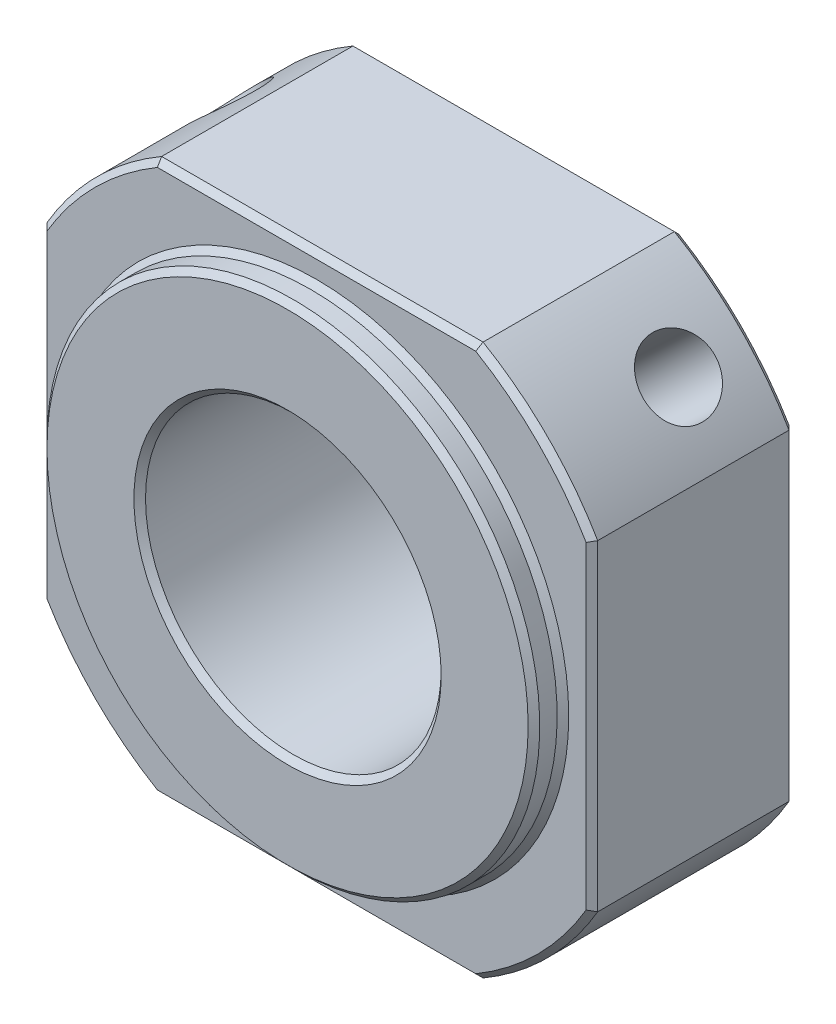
ISO-10303-21;
HEADER;
FILE_DESCRIPTION(('STEP AP214'),'2;1');
FILE_NAME('part.step','',(''),(''),'','','');
FILE_SCHEMA(('AUTOMOTIVE_DESIGN { 1 0 10303 214 1 1 1 1 }'));
ENDSEC;
DATA;
#1=APPLICATION_CONTEXT('core data for automotive mechanical design processes');
#2=APPLICATION_PROTOCOL_DEFINITION('international standard','automotive_design',2000,#1);
#3=PRODUCT_CONTEXT('',#1,'mechanical');
#4=PRODUCT('Part','Part','',(#3));
#5=PRODUCT_RELATED_PRODUCT_CATEGORY('part','',(#4));
#6=PRODUCT_DEFINITION_FORMATION('','',#4);
#7=PRODUCT_DEFINITION_CONTEXT('part definition',#1,'design');
#8=PRODUCT_DEFINITION('design','',#6,#7);
#9=PRODUCT_DEFINITION_SHAPE('','',#8);
#10=(LENGTH_UNIT() NAMED_UNIT(*) SI_UNIT(.MILLI.,.METRE.));
#11=(NAMED_UNIT(*) PLANE_ANGLE_UNIT() SI_UNIT($,.RADIAN.));
#12=(NAMED_UNIT(*) SI_UNIT($,.STERADIAN.) SOLID_ANGLE_UNIT());
#13=UNCERTAINTY_MEASURE_WITH_UNIT(LENGTH_MEASURE(1.E-05),#10,'distance_accuracy_value','');
#14=(GEOMETRIC_REPRESENTATION_CONTEXT(3) GLOBAL_UNCERTAINTY_ASSIGNED_CONTEXT((#13)) GLOBAL_UNIT_ASSIGNED_CONTEXT((#10,
#11,#12)) REPRESENTATION_CONTEXT('',''));
#15=CARTESIAN_POINT('',(0.,0.,0.));
#16=DIRECTION('',(0.,0.,1.));
#17=DIRECTION('',(1.,0.,0.));
#18=AXIS2_PLACEMENT_3D('',#15,#16,#17);
#19=CARTESIAN_POINT('',(0.,0.,4.3));
#20=DIRECTION('',(0.,0.,-1.));
#21=DIRECTION('',(-1.,0.,0.));
#22=AXIS2_PLACEMENT_3D('',#19,#20,#21);
#23=CYLINDRICAL_SURFACE('',#22,8.5);
#24=CARTESIAN_POINT('',(0.,0.,4.29999999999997));
#25=DIRECTION('',(0.,0.,-1.));
#26=DIRECTION('',(-1.,0.,0.));
#27=AXIS2_PLACEMENT_3D('',#24,#25,#26);
#28=CIRCLE('',#27,8.5);
#29=CARTESIAN_POINT('',(-8.5,0.,4.3));
#30=VERTEX_POINT('',#29);
#31=EDGE_CURVE('E168',#30,#30,#28,.T.);
#32=ORIENTED_EDGE('',*,*,#31,.T.);
#33=EDGE_LOOP('',(#32));
#34=FACE_BOUND('',#33,.T.);
#35=CARTESIAN_POINT('',(0.,0.,3.70000000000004));
#36=DIRECTION('',(0.,0.,-1.));
#37=DIRECTION('',(0.,1.,0.));
#38=AXIS2_PLACEMENT_3D('',#35,#36,#37);
#39=CIRCLE('',#38,8.5);
#40=CARTESIAN_POINT('',(0.,8.5,3.7));
#41=VERTEX_POINT('',#40);
#42=EDGE_CURVE('E256',#41,#41,#39,.F.);
#43=ORIENTED_EDGE('',*,*,#42,.T.);
#44=EDGE_LOOP('',(#43));
#45=FACE_BOUND('',#44,.T.);
#46=ADVANCED_FACE('F17',(#34,#45),#23,.T.);
#47=CARTESIAN_POINT('',(0.,0.,3.3));
#48=DIRECTION('',(0.,0.,-1.));
#49=DIRECTION('',(-1.,0.,0.));
#50=AXIS2_PLACEMENT_3D('',#47,#48,#49);
#51=CYLINDRICAL_SURFACE('',#50,11.);
#52=DIRECTION('',(0.,0.,1.));
#53=VECTOR('',#52,1.);
#54=CARTESIAN_POINT('',(9.5,-5.545268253,0.));
#55=LINE('',#54,#53);
#56=CARTESIAN_POINT('',(9.50000000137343,-5.54526825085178,-3.30000000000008));
#57=VERTEX_POINT('',#56);
#58=CARTESIAN_POINT('',(9.500000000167,-5.54526825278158,3.30000000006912));
#59=VERTEX_POINT('',#58);
#60=EDGE_CURVE('E140',#57,#59,#55,.T.);
#61=ORIENTED_EDGE('',*,*,#60,.T.);
#62=CARTESIAN_POINT('',(0.,0.,3.30000000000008));
#63=DIRECTION('',(0.,0.,-1.));
#64=DIRECTION('',(0.,1.,0.));
#65=AXIS2_PLACEMENT_3D('',#62,#63,#64);
#66=CIRCLE('',#65,11.);
#67=CARTESIAN_POINT('',(5.54526825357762,-9.49999999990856,3.30000000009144));
#68=VERTEX_POINT('',#67);
#69=EDGE_CURVE('E135',#59,#68,#66,.T.);
#70=ORIENTED_EDGE('',*,*,#69,.T.);
#71=DIRECTION('',(0.,0.,-1.));
#72=VECTOR('',#71,1.);
#73=CARTESIAN_POINT('',(5.545268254,-9.5,-4.99999998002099E-10));
#74=LINE('',#73,#72);
#75=CARTESIAN_POINT('',(5.54526825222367,-9.50000000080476,-3.30000000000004));
#76=VERTEX_POINT('',#75);
#77=EDGE_CURVE('E149',#68,#76,#74,.T.);
#78=ORIENTED_EDGE('',*,*,#77,.T.);
#79=CARTESIAN_POINT('',(0.,0.,-3.30000000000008));
#80=DIRECTION('',(0.,0.,1.));
#81=DIRECTION('',(0.,-1.,0.));
#82=AXIS2_PLACEMENT_3D('',#79,#80,#81);
#83=CIRCLE('',#82,11.);
#84=EDGE_CURVE('E253',#76,#57,#83,.T.);
#85=ORIENTED_EDGE('',*,*,#84,.T.);
#86=EDGE_LOOP('',(#61,#70,#78,#85));
#87=FACE_BOUND('',#86,.T.);
#88=ADVANCED_FACE('F160',(#87),#51,.T.);
#89=CARTESIAN_POINT('',(0.,0.,4.5));
#90=DIRECTION('',(0.,0.,-1.));
#91=DIRECTION('',(-1.,0.,0.));
#92=AXIS2_PLACEMENT_3D('',#89,#90,#91);
#93=CONICAL_SURFACE('',#92,8.3,0.785398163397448);
#94=ORIENTED_EDGE('',*,*,#31,.F.);
#95=EDGE_LOOP('',(#94));
#96=FACE_BOUND('',#95,.T.);
#97=CARTESIAN_POINT('',(0.,0.,4.49999999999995));
#98=DIRECTION('',(0.,0.,-1.));
#99=DIRECTION('',(-1.,0.,0.));
#100=AXIS2_PLACEMENT_3D('',#97,#98,#99);
#101=CIRCLE('',#100,8.30000000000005);
#102=CARTESIAN_POINT('',(-8.30000000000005,0.,4.49999999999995));
#103=VERTEX_POINT('',#102);
#104=EDGE_CURVE('E510',#103,#103,#101,.F.);
#105=ORIENTED_EDGE('',*,*,#104,.F.);
#106=EDGE_LOOP('',(#105));
#107=FACE_BOUND('',#106,.T.);
#108=ADVANCED_FACE('F532',(#96,#107),#93,.T.);
#109=CARTESIAN_POINT('',(9.5,-5.545268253,-3.3));
#110=DIRECTION('',(-1.,0.,0.));
#111=DIRECTION('',(0.,0.,1.));
#112=AXIS2_PLACEMENT_3D('',#109,#110,#111);
#113=PLANE('',#112);
#114=DIRECTION('',(0.,0.,-1.));
#115=VECTOR('',#114,1.);
#116=CARTESIAN_POINT('',(9.4999999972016,5.54526825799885,0.));
#117=LINE('',#116,#115);
#118=CARTESIAN_POINT('',(9.4999999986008,5.54526825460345,-3.3000000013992));
#119=VERTEX_POINT('',#118);
#120=CARTESIAN_POINT('',(9.4999999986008,5.54526825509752,3.3));
#121=VERTEX_POINT('',#120);
#122=EDGE_CURVE('E244',#119,#121,#117,.F.);
#123=ORIENTED_EDGE('',*,*,#122,.T.);
#124=DIRECTION('',(0.,1.,0.));
#125=VECTOR('',#124,1.);
#126=CARTESIAN_POINT('',(9.5,4.99999781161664E-10,3.3));
#127=LINE('',#126,#125);
#128=EDGE_CURVE('E164',#59,#121,#127,.T.);
#129=ORIENTED_EDGE('',*,*,#128,.F.);
#130=ORIENTED_EDGE('',*,*,#60,.F.);
#131=DIRECTION('',(0.,1.,0.));
#132=VECTOR('',#131,1.);
#133=CARTESIAN_POINT('',(9.5,5.00000214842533E-10,-3.3));
#134=LINE('',#133,#132);
#135=EDGE_CURVE('E248',#57,#119,#134,.T.);
#136=ORIENTED_EDGE('',*,*,#135,.T.);
#137=EDGE_LOOP('',(#123,#129,#130,#136));
#138=FACE_BOUND('',#137,.T.);
#139=ADVANCED_FACE('F491',(#138),#113,.F.);
#140=CARTESIAN_POINT('',(5.611811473,-9.3,3.5));
#141=DIRECTION('',(0.,-0.70710678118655,0.707106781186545));
#142=DIRECTION('',(-1.,0.,0.));
#143=AXIS2_PLACEMENT_3D('',#140,#141,#142);
#144=PLANE('',#143);
#145=CARTESIAN_POINT('',(-5.4909015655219,-9.3000000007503,3.4999999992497));
#146=CARTESIAN_POINT('',(-5.5000057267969,-9.33332748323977,3.46667251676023));
#147=CARTESIAN_POINT('',(-5.5090883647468,-9.36665789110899,3.43334210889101));
#148=CARTESIAN_POINT('',(-5.52721059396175,-9.43332455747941,3.36667544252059));
#149=CARTESIAN_POINT('',(-5.53625018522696,-9.46666081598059,3.33333918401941));
#150=CARTESIAN_POINT('',(-5.54526825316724,-9.4999999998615,3.3000000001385));
#151=B_SPLINE_CURVE_WITH_KNOTS('',3,(#145,#146,#147,#148,#149,#150),.UNSPECIFIED.,.F.,.F.,(4,2,
4),(0.,0.144010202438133,0.288020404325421),.UNSPECIFIED.);
#152=CARTESIAN_POINT('',(-5.49090156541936,-9.30000000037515,3.49999999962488));
#153=VERTEX_POINT('',#152);
#154=CARTESIAN_POINT('',(-5.5452682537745,-9.4999999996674,3.3));
#155=VERTEX_POINT('',#154);
#156=EDGE_CURVE('E145',#153,#155,#151,.T.);
#157=ORIENTED_EDGE('',*,*,#156,.T.);
#158=DIRECTION('',(1.,0.,0.));
#159=VECTOR('',#158,1.);
#160=CARTESIAN_POINT('',(-5.00000214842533E-10,-9.5,3.3));
#161=LINE('',#160,#159);
#162=EDGE_CURVE('E142',#155,#68,#161,.T.);
#163=ORIENTED_EDGE('',*,*,#162,.T.);
#164=CARTESIAN_POINT('',(5.54526825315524,-9.49999999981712,3.30000000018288));
#165=CARTESIAN_POINT('',(5.53625018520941,-9.46666081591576,3.33333918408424));
#166=CARTESIAN_POINT('',(5.52721059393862,-9.43332455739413,3.36667544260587));
#167=CARTESIAN_POINT('',(5.50908836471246,-9.36665789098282,3.43334210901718));
#168=CARTESIAN_POINT('',(5.50000572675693,-9.33332748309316,3.46667251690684));
#169=CARTESIAN_POINT('',(5.49090156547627,-9.30000000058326,3.49999999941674));
#170=B_SPLINE_CURVE_WITH_KNOTS('',3,(#164,#165,#166,#167,#168,#169),.UNSPECIFIED.,.F.,.F.,(4,2,
4),(0.,0.144010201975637,0.288020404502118),.UNSPECIFIED.);
#171=CARTESIAN_POINT('',(5.49090156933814,-9.30000000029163,3.49999999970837));
#172=VERTEX_POINT('',#171);
#173=EDGE_CURVE('E21',#68,#172,#170,.T.);
#174=ORIENTED_EDGE('',*,*,#173,.T.);
#175=DIRECTION('',(1.,0.,0.));
#176=VECTOR('',#175,1.);
#177=CARTESIAN_POINT('',(0.,-9.3,3.5));
#178=LINE('',#177,#176);
#179=EDGE_CURVE('E449',#153,#172,#178,.T.);
#180=ORIENTED_EDGE('',*,*,#179,.F.);
#181=EDGE_LOOP('',(#157,#163,#174,#180));
#182=FACE_BOUND('',#181,.T.);
#183=ADVANCED_FACE('F144',(#182),#144,.T.);
#184=CARTESIAN_POINT('',(0.,0.,3.5));
#185=DIRECTION('',(0.,0.,-1.));
#186=DIRECTION('',(-1.,0.,0.));
#187=AXIS2_PLACEMENT_3D('',#184,#185,#186);
#188=CONICAL_SURFACE('',#187,10.8,0.785398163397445);
#189=CARTESIAN_POINT('',(9.30000000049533,-5.49090156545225,3.49999999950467));
#190=CARTESIAN_POINT('',(9.33332748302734,-5.50000572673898,3.46667251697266));
#191=CARTESIAN_POINT('',(9.3666578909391,-5.50908836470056,3.4333421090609));
#192=CARTESIAN_POINT('',(9.43332455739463,-5.52721059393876,3.36667544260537));
#193=CARTESIAN_POINT('',(9.46666081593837,-5.53625018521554,3.33333918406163));
#194=CARTESIAN_POINT('',(9.49999999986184,-5.54526825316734,3.30000000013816));
#195=B_SPLINE_CURVE_WITH_KNOTS('',3,(#189,#190,#191,#192,#193,#194),.UNSPECIFIED.,.F.,.F.,(4,2,
4),(0.,0.144010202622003,0.288020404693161),.UNSPECIFIED.);
#196=CARTESIAN_POINT('',(9.29999999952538,-5.49090156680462,3.49999999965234));
#197=VERTEX_POINT('',#196);
#198=EDGE_CURVE('E162',#197,#59,#195,.T.);
#199=ORIENTED_EDGE('',*,*,#198,.F.);
#200=CARTESIAN_POINT('',(0.,0.,3.4999999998));
#201=DIRECTION('',(0.,0.,-1.));
#202=DIRECTION('',(-1.,0.,0.));
#203=AXIS2_PLACEMENT_3D('',#200,#201,#202);
#204=CIRCLE('',#203,10.8000000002);
#205=EDGE_CURVE('E137',#172,#197,#204,.F.);
#206=ORIENTED_EDGE('',*,*,#205,.F.);
#207=ORIENTED_EDGE('',*,*,#173,.F.);
#208=ORIENTED_EDGE('',*,*,#69,.F.);
#209=EDGE_LOOP('',(#199,#206,#207,#208));
#210=FACE_BOUND('',#209,.T.);
#211=ADVANCED_FACE('F133',(#210),#188,.T.);
#212=CARTESIAN_POINT('',(9.3,5.611811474,3.5));
#213=DIRECTION('',(0.70710678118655,0.,0.707106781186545));
#214=DIRECTION('',(0.,-1.,0.));
#215=AXIS2_PLACEMENT_3D('',#212,#213,#214);
#216=PLANE('',#215);
#217=ORIENTED_EDGE('',*,*,#198,.T.);
#218=ORIENTED_EDGE('',*,*,#128,.T.);
#219=CARTESIAN_POINT('',(9.4999999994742,5.54526825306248,3.3000000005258));
#220=CARTESIAN_POINT('',(9.46666081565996,5.53625018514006,3.33333918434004));
#221=CARTESIAN_POINT('',(9.43332455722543,5.52721059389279,3.36667544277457));
#222=CARTESIAN_POINT('',(9.36665789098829,5.50908836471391,3.43334210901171));
#223=CARTESIAN_POINT('',(9.3333274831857,5.50000572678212,3.4666725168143));
#224=CARTESIAN_POINT('',(9.30000000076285,5.49090156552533,3.49999999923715));
#225=B_SPLINE_CURVE_WITH_KNOTS('',3,(#219,#220,#221,#222,#223,#224),.UNSPECIFIED.,.F.,.F.,(4,2,
4),(0.,0.144010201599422,0.28802040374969),.UNSPECIFIED.);
#226=CARTESIAN_POINT('',(9.3,5.49090156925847,3.5));
#227=VERTEX_POINT('',#226);
#228=EDGE_CURVE('E258',#121,#227,#225,.T.);
#229=ORIENTED_EDGE('',*,*,#228,.T.);
#230=DIRECTION('',(0.,1.,0.));
#231=VECTOR('',#230,1.);
#232=CARTESIAN_POINT('',(9.3,0.,3.5));
#233=LINE('',#232,#231);
#234=EDGE_CURVE('E451',#197,#227,#233,.T.);
#235=ORIENTED_EDGE('',*,*,#234,.F.);
#236=EDGE_LOOP('',(#217,#218,#229,#235));
#237=FACE_BOUND('',#236,.T.);
#238=ADVANCED_FACE('F284',(#237),#216,.T.);
#239=CARTESIAN_POINT('',(0.,0.,3.5));
#240=DIRECTION('',(0.,0.,-1.));
#241=DIRECTION('',(-1.,0.,0.));
#242=AXIS2_PLACEMENT_3D('',#239,#240,#241);
#243=CONICAL_SURFACE('',#242,10.8,0.785398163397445);
#244=ORIENTED_EDGE('',*,*,#228,.F.);
#245=CARTESIAN_POINT('',(0.,0.,3.3));
#246=DIRECTION('',(0.,0.,-1.));
#247=DIRECTION('',(0.,1.,0.));
#248=AXIS2_PLACEMENT_3D('',#245,#246,#247);
#249=CIRCLE('',#248,11.);
#250=CARTESIAN_POINT('',(5.54526825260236,9.5,3.3));
#251=VERTEX_POINT('',#250);
#252=EDGE_CURVE('E239',#121,#251,#249,.F.);
#253=ORIENTED_EDGE('',*,*,#252,.T.);
#254=CARTESIAN_POINT('',(5.49090156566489,9.3000000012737,3.49999999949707));
#255=CARTESIAN_POINT('',(5.5000057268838,9.33332748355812,3.46667251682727));
#256=CARTESIAN_POINT('',(5.50908836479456,9.36665789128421,3.43334210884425));
#257=CARTESIAN_POINT('',(5.52721059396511,9.43332455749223,3.36667544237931));
#258=CARTESIAN_POINT('',(5.53625018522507,9.46666081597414,3.3333391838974));
#259=CARTESIAN_POINT('',(5.54526825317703,9.4999999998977,3.3000000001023));
#260=B_SPLINE_CURVE_WITH_KNOTS('',3,(#254,#255,#256,#257,#258,#259),.UNSPECIFIED.,.F.,.F.,(4,2,
4),(0.,0.144010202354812,0.288020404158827),.UNSPECIFIED.);
#261=CARTESIAN_POINT('',(5.49090156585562,9.3000000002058,3.49999999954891));
#262=VERTEX_POINT('',#261);
#263=EDGE_CURVE('E238',#262,#251,#260,.T.);
#264=ORIENTED_EDGE('',*,*,#263,.F.);
#265=CARTESIAN_POINT('',(0.,0.,3.5));
#266=DIRECTION('',(0.,0.,-1.));
#267=DIRECTION('',(-1.,0.,0.));
#268=AXIS2_PLACEMENT_3D('',#265,#266,#267);
#269=CIRCLE('',#268,10.8);
#270=EDGE_CURVE('E452',#227,#262,#269,.F.);
#271=ORIENTED_EDGE('',*,*,#270,.F.);
#272=EDGE_LOOP('',(#244,#253,#264,#271));
#273=FACE_BOUND('',#272,.T.);
#274=ADVANCED_FACE('F281',(#273),#243,.T.);
#275=CARTESIAN_POINT('',(0.,0.,3.7));
#276=DIRECTION('',(0.,0.,-1.));
#277=DIRECTION('',(-1.,0.,0.));
#278=AXIS2_PLACEMENT_3D('',#275,#276,#277);
#279=CONICAL_SURFACE('',#278,8.5,0.785398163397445);
#280=ORIENTED_EDGE('',*,*,#42,.F.);
#281=EDGE_LOOP('',(#280));
#282=FACE_BOUND('',#281,.T.);
#283=CARTESIAN_POINT('',(0.,0.,3.50000000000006));
#284=DIRECTION('',(0.,0.,-1.));
#285=DIRECTION('',(-1.,0.,0.));
#286=AXIS2_PLACEMENT_3D('',#283,#284,#285);
#287=CIRCLE('',#286,8.69999999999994);
#288=CARTESIAN_POINT('',(-8.69999999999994,0.,3.50000000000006));
#289=VERTEX_POINT('',#288);
#290=EDGE_CURVE('E454',#289,#289,#287,.T.);
#291=ORIENTED_EDGE('',*,*,#290,.F.);
#292=EDGE_LOOP('',(#291));
#293=FACE_BOUND('',#292,.T.);
#294=ADVANCED_FACE('F596',(#282,#293),#279,.T.);
#295=CARTESIAN_POINT('',(0.,0.,3.5));
#296=DIRECTION('',(0.,0.,-1.));
#297=DIRECTION('',(-1.,0.,0.));
#298=AXIS2_PLACEMENT_3D('',#295,#296,#297);
#299=CONICAL_SURFACE('',#298,10.8,0.785398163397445);
#300=ORIENTED_EDGE('',*,*,#156,.F.);
#301=CARTESIAN_POINT('',(0.,0.,3.50000000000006));
#302=DIRECTION('',(0.,0.,-1.));
#303=DIRECTION('',(-1.,0.,0.));
#304=AXIS2_PLACEMENT_3D('',#301,#302,#303);
#305=CIRCLE('',#304,10.7999999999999);
#306=CARTESIAN_POINT('',(-9.30000000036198,-5.49090156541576,3.49999999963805));
#307=VERTEX_POINT('',#306);
#308=EDGE_CURVE('E446',#307,#153,#305,.F.);
#309=ORIENTED_EDGE('',*,*,#308,.F.);
#310=CARTESIAN_POINT('',(-9.4999999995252,-5.54526825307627,3.30000000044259));
#311=CARTESIAN_POINT('',(-9.46666081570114,-5.53625018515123,3.33333918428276));
#312=CARTESIAN_POINT('',(-9.4333245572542,-5.52721059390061,3.36667544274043));
#313=CARTESIAN_POINT('',(-9.36665789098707,-5.50908836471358,3.4333421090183));
#314=CARTESIAN_POINT('',(-9.3333274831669,-5.500005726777,3.46667251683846));
#315=CARTESIAN_POINT('',(-9.30000000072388,-5.49090156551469,3.49999999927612));
#316=B_SPLINE_CURVE_WITH_KNOTS('',3,(#310,#311,#312,#313,#314,#315),.UNSPECIFIED.,.F.,.F.,(4,2,
4),(0.,0.144010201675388,0.288020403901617),.UNSPECIFIED.);
#317=CARTESIAN_POINT('',(-9.50000000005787,-5.54526825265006,3.30000000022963));
#318=VERTEX_POINT('',#317);
#319=EDGE_CURVE('E335',#318,#307,#316,.T.);
#320=ORIENTED_EDGE('',*,*,#319,.F.);
#321=CARTESIAN_POINT('',(0.,0.,3.3));
#322=DIRECTION('',(0.,0.,-1.));
#323=DIRECTION('',(0.,1.,0.));
#324=AXIS2_PLACEMENT_3D('',#321,#322,#323);
#325=CIRCLE('',#324,11.);
#326=EDGE_CURVE('E217',#318,#155,#325,.F.);
#327=ORIENTED_EDGE('',*,*,#326,.T.);
#328=EDGE_LOOP('',(#300,#309,#320,#327));
#329=FACE_BOUND('',#328,.T.);
#330=ADVANCED_FACE('F294',(#329),#299,.T.);
#331=CARTESIAN_POINT('',(5.545268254,-9.5,-3.300000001));
#332=DIRECTION('',(0.,1.,0.));
#333=DIRECTION('',(-1.,0.,0.));
#334=AXIS2_PLACEMENT_3D('',#331,#332,#333);
#335=PLANE('',#334);
#336=ORIENTED_EDGE('',*,*,#77,.F.);
#337=ORIENTED_EDGE('',*,*,#162,.F.);
#338=DIRECTION('',(0.,0.,1.));
#339=VECTOR('',#338,1.);
#340=CARTESIAN_POINT('',(-5.5452682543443,-9.49999999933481,-4.99999998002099E-10));
#341=LINE('',#340,#339);
#342=CARTESIAN_POINT('',(-5.54526825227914,-9.4999999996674,-3.3000000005));
#343=VERTEX_POINT('',#342);
#344=EDGE_CURVE('E212',#155,#343,#341,.F.);
#345=ORIENTED_EDGE('',*,*,#344,.T.);
#346=DIRECTION('',(1.,0.,0.));
#347=VECTOR('',#346,1.);
#348=CARTESIAN_POINT('',(0.,-9.5,-3.3));
#349=LINE('',#348,#347);
#350=EDGE_CURVE('E153',#343,#76,#349,.T.);
#351=ORIENTED_EDGE('',*,*,#350,.T.);
#352=EDGE_LOOP('',(#336,#337,#345,#351));
#353=FACE_BOUND('',#352,.T.);
#354=ADVANCED_FACE('F152',(#353),#335,.F.);
#355=CARTESIAN_POINT('',(0.,0.,-3.5));
#356=DIRECTION('',(0.,0.,1.));
#357=DIRECTION('',(1.,0.,0.));
#358=AXIS2_PLACEMENT_3D('',#355,#356,#357);
#359=CONICAL_SURFACE('',#358,10.8,0.785398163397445);
#360=CARTESIAN_POINT('',(-9.49999999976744,-5.5452682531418,-3.30000000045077));
#361=CARTESIAN_POINT('',(-9.46666081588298,-5.53625018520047,-3.33333918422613));
#362=CARTESIAN_POINT('',(-9.43332455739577,-5.52721059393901,-3.3666754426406));
#363=CARTESIAN_POINT('',(-9.36665789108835,-5.50908836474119,-3.43334210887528));
#364=CARTESIAN_POINT('',(-9.33332748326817,-5.50000572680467,-3.46667251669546));
#365=CARTESIAN_POINT('',(-9.30000000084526,-5.49090156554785,-3.49999999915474));
#366=B_SPLINE_CURVE_WITH_KNOTS('',3,(#360,#361,#362,#363,#364,#365),.UNSPECIFIED.,.F.,.F.,(4,2,
4),(0.,0.144010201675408,0.288020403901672),.UNSPECIFIED.);
#367=CARTESIAN_POINT('',(-9.5,-5.54526825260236,-3.3000000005));
#368=VERTEX_POINT('',#367);
#369=CARTESIAN_POINT('',(-9.30000000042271,-5.49090156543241,-3.49999999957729));
#370=VERTEX_POINT('',#369);
#371=EDGE_CURVE('E211',#368,#370,#366,.T.);
#372=ORIENTED_EDGE('',*,*,#371,.T.);
#373=CARTESIAN_POINT('',(0.,0.,-3.5));
#374=DIRECTION('',(0.,0.,1.));
#375=DIRECTION('',(1.,0.,0.));
#376=AXIS2_PLACEMENT_3D('',#373,#374,#375);
#377=CIRCLE('',#376,10.8);
#378=CARTESIAN_POINT('',(-5.49090156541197,-9.30000000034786,-3.49999999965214));
#379=VERTEX_POINT('',#378);
#380=EDGE_CURVE('E796',#370,#379,#377,.T.);
#381=ORIENTED_EDGE('',*,*,#380,.T.);
#382=CARTESIAN_POINT('',(-5.49090156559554,-9.30000000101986,-3.49999999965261));
#383=CARTESIAN_POINT('',(-5.5000057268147,-9.33332748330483,-3.46667251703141));
#384=CARTESIAN_POINT('',(-5.50908836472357,-9.36665789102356,-3.43334210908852));
#385=CARTESIAN_POINT('',(-5.52721059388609,-9.43332455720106,-3.36667544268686));
#386=CARTESIAN_POINT('',(-5.53625018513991,-9.4666608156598,-3.33333918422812));
#387=CARTESIAN_POINT('',(-5.5452682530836,-9.49999999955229,-3.30000000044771));
#388=B_SPLINE_CURVE_WITH_KNOTS('',3,(#382,#383,#384,#385,#386,#387),.UNSPECIFIED.,.F.,.F.,(4,2,
4),(0.,0.144010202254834,0.288020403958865),.UNSPECIFIED.);
#389=EDGE_CURVE('E157',#379,#343,#388,.T.);
#390=ORIENTED_EDGE('',*,*,#389,.T.);
#391=CARTESIAN_POINT('',(0.,0.,-3.300000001));
#392=DIRECTION('',(0.,0.,-1.));
#393=DIRECTION('',(0.,1.,0.));
#394=AXIS2_PLACEMENT_3D('',#391,#392,#393);
#395=CIRCLE('',#394,11.);
#396=EDGE_CURVE('E208',#343,#368,#395,.T.);
#397=ORIENTED_EDGE('',*,*,#396,.T.);
#398=EDGE_LOOP('',(#372,#381,#390,#397));
#399=FACE_BOUND('',#398,.T.);
#400=ADVANCED_FACE('F293',(#399),#359,.T.);
#401=CARTESIAN_POINT('',(-5.611811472,-9.5,-3.3));
#402=DIRECTION('',(0.,0.70710678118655,0.707106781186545));
#403=DIRECTION('',(1.,0.,0.));
#404=AXIS2_PLACEMENT_3D('',#401,#402,#403);
#405=PLANE('',#404);
#406=CARTESIAN_POINT('',(5.49090156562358,-9.30000000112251,-3.49999999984));
#407=CARTESIAN_POINT('',(5.50000572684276,-9.3333274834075,-3.46667251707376));
#408=CARTESIAN_POINT('',(5.50908836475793,-9.36665789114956,-3.43334210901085));
#409=CARTESIAN_POINT('',(5.5272105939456,-9.43332455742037,-3.36667544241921));
#410=CARTESIAN_POINT('',(5.53625018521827,-9.46666081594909,-3.33333918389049));
#411=CARTESIAN_POINT('',(5.54526825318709,-9.49999999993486,-3.30000000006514));
#412=B_SPLINE_CURVE_WITH_KNOTS('',3,(#406,#407,#408,#409,#410,#411),.UNSPECIFIED.,.F.,.F.,(4,2,
4),(0.,0.144010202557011,0.288020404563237),.UNSPECIFIED.);
#413=CARTESIAN_POINT('',(5.49090156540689,-9.30000000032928,-3.49999999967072));
#414=VERTEX_POINT('',#413);
#415=EDGE_CURVE('E255',#414,#76,#412,.T.);
#416=ORIENTED_EDGE('',*,*,#415,.T.);
#417=ORIENTED_EDGE('',*,*,#350,.F.);
#418=ORIENTED_EDGE('',*,*,#389,.F.);
#419=DIRECTION('',(1.,0.,0.));
#420=VECTOR('',#419,1.);
#421=CARTESIAN_POINT('',(0.,-9.3,-3.5));
#422=LINE('',#421,#420);
#423=EDGE_CURVE('E795',#379,#414,#422,.T.);
#424=ORIENTED_EDGE('',*,*,#423,.T.);
#425=EDGE_LOOP('',(#416,#417,#418,#424));
#426=FACE_BOUND('',#425,.T.);
#427=ADVANCED_FACE('F295',(#426),#405,.F.);
#428=CARTESIAN_POINT('',(0.,0.,-3.5));
#429=DIRECTION('',(0.,0.,1.));
#430=DIRECTION('',(1.,0.,0.));
#431=AXIS2_PLACEMENT_3D('',#428,#429,#430);
#432=CONICAL_SURFACE('',#431,10.8,0.785398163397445);
#433=CARTESIAN_POINT('',(9.30000000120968,-5.4909015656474,-3.49999999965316));
#434=CARTESIAN_POINT('',(9.33332748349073,-5.50000572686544,-3.46667251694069));
#435=CARTESIAN_POINT('',(9.36665789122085,-5.50908836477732,-3.43334210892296));
#436=CARTESIAN_POINT('',(9.43332455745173,-5.52721059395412,-3.36667544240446));
#437=CARTESIAN_POINT('',(9.46666081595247,-5.53625018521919,-3.33333918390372));
#438=CARTESIAN_POINT('',(9.49999999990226,-5.54526825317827,-3.30000000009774));
#439=B_SPLINE_CURVE_WITH_KNOTS('',3,(#433,#434,#435,#436,#437,#438),.UNSPECIFIED.,.F.,.F.,(4,2,
4),(0.,0.144010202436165,0.288020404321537),.UNSPECIFIED.);
#440=CARTESIAN_POINT('',(9.30000000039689,-5.49090156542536,-3.49999999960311));
#441=VERTEX_POINT('',#440);
#442=EDGE_CURVE('E251',#441,#57,#439,.T.);
#443=ORIENTED_EDGE('',*,*,#442,.T.);
#444=ORIENTED_EDGE('',*,*,#84,.F.);
#445=ORIENTED_EDGE('',*,*,#415,.F.);
#446=CARTESIAN_POINT('',(0.,0.,-3.5));
#447=DIRECTION('',(0.,0.,1.));
#448=DIRECTION('',(1.,0.,0.));
#449=AXIS2_PLACEMENT_3D('',#446,#447,#448);
#450=CIRCLE('',#449,10.8);
#451=EDGE_CURVE('E501',#414,#441,#450,.T.);
#452=ORIENTED_EDGE('',*,*,#451,.T.);
#453=EDGE_LOOP('',(#443,#444,#445,#452));
#454=FACE_BOUND('',#453,.T.);
#455=ADVANCED_FACE('F299',(#454),#432,.T.);
#456=CARTESIAN_POINT('',(9.5,-5.611811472,-3.3));
#457=DIRECTION('',(-0.70710678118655,0.,0.707106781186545));
#458=DIRECTION('',(0.,1.,0.));
#459=AXIS2_PLACEMENT_3D('',#456,#457,#458);
#460=PLANE('',#459);
#461=CARTESIAN_POINT('',(9.30000000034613,5.49090156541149,-3.49999999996));
#462=CARTESIAN_POINT('',(9.33332748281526,5.50000572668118,-3.46667251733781));
#463=CARTESIAN_POINT('',(9.36665789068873,5.50908836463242,-3.43334210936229));
#464=CARTESIAN_POINT('',(9.43332455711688,5.52721059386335,-3.3666754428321));
#465=CARTESIAN_POINT('',(9.46666081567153,5.5362501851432,-3.33333918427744));
#466=CARTESIAN_POINT('',(9.49999999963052,5.54526825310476,-3.30000000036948));
#467=B_SPLINE_CURVE_WITH_KNOTS('',3,(#461,#462,#463,#464,#465,#466),.UNSPECIFIED.,.F.,.F.,(4,2,
4),(0.,0.144010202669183,0.288020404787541),.UNSPECIFIED.);
#468=CARTESIAN_POINT('',(9.30000000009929,5.49090156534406,-3.49999999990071));
#469=VERTEX_POINT('',#468);
#470=EDGE_CURVE('E250',#469,#119,#467,.T.);
#471=ORIENTED_EDGE('',*,*,#470,.T.);
#472=ORIENTED_EDGE('',*,*,#135,.F.);
#473=ORIENTED_EDGE('',*,*,#442,.F.);
#474=DIRECTION('',(0.,1.,0.));
#475=VECTOR('',#474,1.);
#476=CARTESIAN_POINT('',(9.3,5.00000214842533E-10,-3.5));
#477=LINE('',#476,#475);
#478=EDGE_CURVE('E794',#441,#469,#477,.T.);
#479=ORIENTED_EDGE('',*,*,#478,.T.);
#480=EDGE_LOOP('',(#471,#472,#473,#479));
#481=FACE_BOUND('',#480,.T.);
#482=ADVANCED_FACE('F301',(#481),#460,.F.);
#483=CARTESIAN_POINT('',(0.,0.,-3.5));
#484=DIRECTION('',(0.,0.,1.));
#485=DIRECTION('',(1.,0.,0.));
#486=AXIS2_PLACEMENT_3D('',#483,#484,#485);
#487=CONICAL_SURFACE('',#486,10.8,0.785398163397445);
#488=CARTESIAN_POINT('',(5.49090156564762,9.30000000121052,-3.49999999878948));
#489=CARTESIAN_POINT('',(5.50000572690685,9.33332748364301,-3.46667251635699));
#490=CARTESIAN_POINT('',(5.50908836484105,9.36665789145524,-3.43334210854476));
#491=CARTESIAN_POINT('',(5.52721059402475,9.43332455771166,-3.36667544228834));
#492=CARTESIAN_POINT('',(5.53625018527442,9.46666081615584,-3.33333918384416));
#493=CARTESIAN_POINT('',(5.54526825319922,9.49999999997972,-3.30000000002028));
#494=B_SPLINE_CURVE_WITH_KNOTS('',3,(#488,#489,#490,#491,#492,#493),.UNSPECIFIED.,.F.,.F.,(4,2,
4),(0.,0.144010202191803,0.288020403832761),.UNSPECIFIED.);
#495=CARTESIAN_POINT('',(5.49090156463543,9.30000000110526,-3.49999999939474));
#496=VERTEX_POINT('',#495);
#497=CARTESIAN_POINT('',(5.5452682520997,9.50000000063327,-3.30000000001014));
#498=VERTEX_POINT('',#497);
#499=EDGE_CURVE('E418',#496,#498,#494,.T.);
#500=ORIENTED_EDGE('',*,*,#499,.T.);
#501=CARTESIAN_POINT('',(0.,0.,-3.3));
#502=DIRECTION('',(0.,0.,-1.));
#503=DIRECTION('',(0.,1.,0.));
#504=AXIS2_PLACEMENT_3D('',#501,#502,#503);
#505=CIRCLE('',#504,11.);
#506=EDGE_CURVE('E235',#498,#119,#505,.T.);
#507=ORIENTED_EDGE('',*,*,#506,.T.);
#508=ORIENTED_EDGE('',*,*,#470,.F.);
#509=CARTESIAN_POINT('',(0.,0.,-3.5));
#510=DIRECTION('',(0.,0.,1.));
#511=DIRECTION('',(1.,0.,0.));
#512=AXIS2_PLACEMENT_3D('',#509,#510,#511);
#513=CIRCLE('',#512,10.8);
#514=EDGE_CURVE('E791',#469,#496,#513,.T.);
#515=ORIENTED_EDGE('',*,*,#514,.T.);
#516=EDGE_LOOP('',(#500,#507,#508,#515));
#517=FACE_BOUND('',#516,.T.);
#518=ADVANCED_FACE('F511',(#517),#487,.T.);
#519=CARTESIAN_POINT('',(-8.3996,-8.3996,4.5));
#520=DIRECTION('',(0.,0.,1.));
#521=DIRECTION('',(1.,0.,0.));
#522=AXIS2_PLACEMENT_3D('',#519,#520,#521);
#523=PLANE('',#522);
#524=CARTESIAN_POINT('',(0.,0.,4.49999999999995));
#525=DIRECTION('',(0.,0.,1.));
#526=DIRECTION('',(1.,0.,0.));
#527=AXIS2_PLACEMENT_3D('',#524,#525,#526);
#528=CIRCLE('',#527,5.29999999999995);
#529=CARTESIAN_POINT('',(5.29999999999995,0.,4.49999999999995));
#530=VERTEX_POINT('',#529);
#531=EDGE_CURVE('E783',#530,#530,#528,.T.);
#532=ORIENTED_EDGE('',*,*,#531,.F.);
#533=EDGE_LOOP('',(#532));
#534=FACE_BOUND('',#533,.T.);
#535=ORIENTED_EDGE('',*,*,#104,.T.);
#536=EDGE_LOOP('',(#535));
#537=FACE_BOUND('',#536,.T.);
#538=ADVANCED_FACE('F434',(#534,#537),#523,.T.);
#539=CARTESIAN_POINT('',(3.57065550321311,3.36747554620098,-1.));
#540=DIRECTION('',(0.727502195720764,0.686105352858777,0.));
#541=DIRECTION('',(-0.686105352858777,0.727502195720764,0.));
#542=AXIS2_PLACEMENT_3D('',#539,#540,#541);
#543=CYLINDRICAL_SURFACE('',#542,1.25000000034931);
#544=CARTESIAN_POINT('',(7.0930553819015,8.40764921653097,-1.0000000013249));
#545=CARTESIAN_POINT('',(7.09305813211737,8.40764762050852,-0.930093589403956));
#546=CARTESIAN_POINT('',(7.09758919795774,8.40383074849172,-0.86009506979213));
#547=CARTESIAN_POINT('',(7.11556312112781,8.38861699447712,-0.721994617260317));
#548=CARTESIAN_POINT('',(7.12902460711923,8.37720426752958,-0.653896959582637));
#549=CARTESIAN_POINT('',(7.16433991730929,8.34702159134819,-0.52168908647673));
#550=CARTESIAN_POINT('',(7.18618507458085,8.32825923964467,-0.457574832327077));
#551=CARTESIAN_POINT('',(7.23744579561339,8.28375064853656,-0.335092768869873));
#552=CARTESIAN_POINT('',(7.26685813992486,8.25800737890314,-0.276722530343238));
#553=CARTESIAN_POINT('',(7.33234255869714,8.19991894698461,-0.167075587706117));
#554=CARTESIAN_POINT('',(7.36844236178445,8.16754623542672,-0.115830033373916));
#555=CARTESIAN_POINT('',(7.4459641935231,8.09693526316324,-0.0221546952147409));
#556=CARTESIAN_POINT('',(7.48738673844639,8.05869643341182,0.0202742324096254));
#557=CARTESIAN_POINT('',(7.57427582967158,7.97708607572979,0.0952156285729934));
#558=CARTESIAN_POINT('',(7.61975299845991,7.93370096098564,0.12770099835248));
#559=CARTESIAN_POINT('',(7.71316529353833,7.8429151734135,0.181659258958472));
#560=CARTESIAN_POINT('',(7.76110032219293,7.79551466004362,0.203132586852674));
#561=CARTESIAN_POINT('',(7.8577049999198,7.6981266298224,0.234367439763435));
#562=CARTESIAN_POINT('',(7.90637056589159,7.64815121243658,0.24417930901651));
#563=CARTESIAN_POINT('',(8.00317732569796,7.5467915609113,0.251968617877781));
#564=CARTESIAN_POINT('',(8.05131853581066,7.49540737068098,0.249946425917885));
#565=CARTESIAN_POINT('',(8.14549213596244,7.39295466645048,0.234165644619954));
#566=CARTESIAN_POINT('',(8.19153323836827,7.34188579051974,0.220461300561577));
#567=CARTESIAN_POINT('',(8.28053672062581,7.24135497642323,0.181789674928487));
#568=CARTESIAN_POINT('',(8.32349902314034,7.1918930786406,0.15682211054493));
#569=CARTESIAN_POINT('',(8.4053987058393,7.09600322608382,0.0962732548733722));
#570=CARTESIAN_POINT('',(8.44432667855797,7.04958245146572,0.060667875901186));
#571=CARTESIAN_POINT('',(8.5171766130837,6.96139203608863,-0.0201252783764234));
#572=CARTESIAN_POINT('',(8.55109879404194,6.91962219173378,-0.0653126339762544));
#573=CARTESIAN_POINT('',(8.61341318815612,6.84190129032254,-0.164282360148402));
#574=CARTESIAN_POINT('',(8.64177419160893,6.80598325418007,-0.218110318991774));
#575=CARTESIAN_POINT('',(8.69219327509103,6.74147303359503,-0.33270813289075));
#576=CARTESIAN_POINT('',(8.71424845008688,6.71288422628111,-0.393481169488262));
#577=CARTESIAN_POINT('',(8.75164799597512,6.66405344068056,-0.520297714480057));
#578=CARTESIAN_POINT('',(8.76698475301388,6.64382093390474,-0.58634710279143));
#579=CARTESIAN_POINT('',(8.79060783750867,6.61253386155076,-0.721695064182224));
#580=CARTESIAN_POINT('',(8.79890911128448,6.60145984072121,-0.79098641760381));
#581=CARTESIAN_POINT('',(8.80519488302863,6.59306803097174,-0.88395540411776));
#582=CARTESIAN_POINT('',(8.80636567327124,6.59150403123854,-0.907118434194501));
#583=CARTESIAN_POINT('',(8.80792785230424,6.58941640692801,-0.953517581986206));
#584=CARTESIAN_POINT('',(8.80831924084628,6.58889278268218,-0.976753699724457));
#585=CARTESIAN_POINT('',(8.80831733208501,6.58889656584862,-1.06990641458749));
#586=CARTESIAN_POINT('',(8.80477215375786,6.59364322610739,-1.13990493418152));
#587=CARTESIAN_POINT('',(8.79063628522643,6.61247663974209,-1.27800538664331));
#588=CARTESIAN_POINT('',(8.78003086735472,6.62658291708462,-1.34610304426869));
#589=CARTESIAN_POINT('',(8.75196652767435,6.66360396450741,-1.47831091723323));
#590=CARTESIAN_POINT('',(8.73451468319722,6.68650963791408,-1.54242517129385));
#591=CARTESIAN_POINT('',(8.69308208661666,6.74028710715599,-1.66490723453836));
#592=CARTESIAN_POINT('',(8.66910411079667,6.77115551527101,-1.7232774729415));
#593=CARTESIAN_POINT('',(8.61494730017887,6.83992698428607,-1.83292441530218));
#594=CARTESIAN_POINT('',(8.5847425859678,6.87785933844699,-1.88416996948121));
#595=CARTESIAN_POINT('',(8.51878911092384,6.95938039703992,-1.97784530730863));
#596=CARTESIAN_POINT('',(8.48303981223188,7.00296965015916,-2.02027423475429));
#597=CARTESIAN_POINT('',(8.40665396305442,7.09448558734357,-2.09521563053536));
#598=CARTESIAN_POINT('',(8.36600447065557,7.1424236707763,-2.1277010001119));
#599=CARTESIAN_POINT('',(8.28084064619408,7.24098856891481,-2.18165926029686));
#600=CARTESIAN_POINT('',(8.23632646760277,7.29161527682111,-2.20313258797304));
#601=CARTESIAN_POINT('',(8.1447585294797,7.3937534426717,-2.23436744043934));
#602=CARTESIAN_POINT('',(8.09771660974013,7.44526011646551,-2.24417930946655));
#603=CARTESIAN_POINT('',(8.0021956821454,7.54783243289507,-2.25196861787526));
#604=CARTESIAN_POINT('',(7.95371671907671,7.59889808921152,-2.24994642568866));
#605=CARTESIAN_POINT('',(7.8569505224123,7.69890572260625,-2.23416564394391));
#606=CARTESIAN_POINT('',(7.80866343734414,7.74785641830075,-2.22046129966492));
#607=CARTESIAN_POINT('',(7.71351328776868,7.84259032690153,-2.18178967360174));
#608=CARTESIAN_POINT('',(7.66665025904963,7.88837346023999,-2.15682210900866));
#609=CARTESIAN_POINT('',(7.57571741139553,7.97574415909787,-2.09627325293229));
#610=CARTESIAN_POINT('',(7.53165420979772,8.01732191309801,-2.06066787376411));
#611=CARTESIAN_POINT('',(7.44787802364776,8.09520780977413,-1.97987471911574));
#612=CARTESIAN_POINT('',(7.40816484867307,8.13151618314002,-1.93468736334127));
#613=CARTESIAN_POINT('',(7.33422370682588,8.19827192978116,-1.8357176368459));
#614=CARTESIAN_POINT('',(7.30002687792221,8.22868621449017,-1.78188967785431));
#615=CARTESIAN_POINT('',(7.23857767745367,8.28279396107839,-1.66729186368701));
#616=CARTESIAN_POINT('',(7.211328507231,8.30648432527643,-1.60651882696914));
#617=CARTESIAN_POINT('',(7.16476998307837,8.34667730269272,-1.47970228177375));
#618=CARTESIAN_POINT('',(7.1454696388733,8.36317176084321,-1.41365289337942));
#619=CARTESIAN_POINT('',(7.11561858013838,8.38858524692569,-1.27830493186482));
#620=CARTESIAN_POINT('',(7.10504931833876,8.39752033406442,-1.20901357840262));
#621=CARTESIAN_POINT('',(7.09703972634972,8.40428641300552,-1.11604459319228));
#622=CARTESIAN_POINT('',(7.09554692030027,8.40554672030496,-1.09288156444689));
#623=CARTESIAN_POINT('',(7.09355429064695,8.40722838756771,-1.04648241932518));
#624=CARTESIAN_POINT('',(7.09305446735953,8.40764974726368,-1.02324630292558));
#625=CARTESIAN_POINT('',(7.0930553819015,8.40764921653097,-1.0000000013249));
#626=B_SPLINE_CURVE_WITH_KNOTS('',3,(#544,#545,#546,#547,#548,#549,#550,#551,#552,#553,#554,
#555,#556,#557,#558,#559,#560,#561,#562,#563,#564,#565,#566,#567,#568,#569,#570,#571,#572,#573,
#574,#575,#576,#577,#578,#579,#580,#581,#582,#583,#584,#585,#586,#587,#588,#589,#590,#591,#592,
#593,#594,#595,#596,#597,#598,#599,#600,#601,#602,#603,#604,#605,#606,#607,#608,#609,#610,#611,
#612,#613,#614,#615,#616,#617,#618,#619,#620,#621,#622,#623,#624,#625),.UNSPECIFIED.,.T.,.F.,(4,
2,2,2,2,2,2,2,2,2,2,2,2,2,2,2,2,2,2,2,2,2,2,2,2,2,2,2,2,2,2,2,2,2,2,2,2,2,2,2,4),(0.,
0.209630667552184,0.419700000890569,0.629552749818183,0.839316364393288,1.04997003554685,
1.26064415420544,1.4718874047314,1.68312227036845,1.89344185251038,2.10375488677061,
2.31309663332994,2.52244363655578,2.73226831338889,2.94208380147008,3.15304505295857,
3.36410333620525,3.57540019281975,3.78624703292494,3.85595646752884,3.92566592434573,
4.13529659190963,4.34536592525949,4.55521867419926,4.76498228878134,4.97563595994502,
5.18631007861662,5.39755332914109,5.60878819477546,5.81910777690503,6.02942081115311,
6.23876255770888,6.44810956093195,6.65793423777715,6.86774972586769,7.07871097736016,
7.28976926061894,7.50106611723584,7.71191295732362,7.78162238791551,7.85133184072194),.UNSPECIFIED.);
#627=CARTESIAN_POINT('',(7.0930553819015,8.40764921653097,-1.0000000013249));
#628=VERTEX_POINT('',#627);
#629=EDGE_CURVE('E247',#628,#628,#626,.T.);
#630=ORIENTED_EDGE('',*,*,#629,.T.);
#631=EDGE_LOOP('',(#630));
#632=FACE_BOUND('',#631,.T.);
#633=CARTESIAN_POINT('',(4.45472361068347,2.4830299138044,-0.999999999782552));
#634=CARTESIAN_POINT('',(4.45472281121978,2.48303401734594,-1.06899276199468));
#635=CARTESIAN_POINT('',(4.4518503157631,2.48820665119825,-1.13806741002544));
#636=CARTESIAN_POINT('',(4.44035450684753,2.50866170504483,-1.2742968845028));
#637=CARTESIAN_POINT('',(4.43172024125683,2.52396337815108,-1.34144780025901));
#638=CARTESIAN_POINT('',(4.40873160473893,2.56390564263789,-1.47174906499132));
#639=CARTESIAN_POINT('',(4.39438732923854,2.58852974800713,-1.53490624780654));
#640=CARTESIAN_POINT('',(4.36002001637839,2.64600480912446,-1.65565310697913));
#641=CARTESIAN_POINT('',(4.33999843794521,2.67885365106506,-1.7132442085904));
#642=CARTESIAN_POINT('',(4.2939055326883,2.75214098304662,-1.82247320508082));
#643=CARTESIAN_POINT('',(4.26772550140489,2.79271300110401,-1.87397567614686));
#644=CARTESIAN_POINT('',(4.20969319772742,2.87944463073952,-1.96837449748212));
#645=CARTESIAN_POINT('',(4.17784010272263,2.92560505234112,-2.01126959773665));
#646=CARTESIAN_POINT('',(4.10831602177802,3.02247170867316,-2.08777958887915));
#647=CARTESIAN_POINT('',(4.07057302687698,3.07323041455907,-2.12126290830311));
#648=CARTESIAN_POINT('',(3.99017588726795,3.17691573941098,-2.17714367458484));
#649=CARTESIAN_POINT('',(3.94752247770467,3.22984203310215,-2.19954277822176));
#650=CARTESIAN_POINT('',(3.85908945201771,3.33497419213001,-2.23218982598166));
#651=CARTESIAN_POINT('',(3.81338702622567,3.38717397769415,-2.24266622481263));
#652=CARTESIAN_POINT('',(3.71932821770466,3.49019478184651,-2.25188710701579));
#653=CARTESIAN_POINT('',(3.6709722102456,3.54101599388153,-2.2506332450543));
#654=CARTESIAN_POINT('',(3.5741126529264,3.63872963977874,-2.23659449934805));
#655=CARTESIAN_POINT('',(3.52563426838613,3.68568276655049,-2.22405623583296));
#656=CARTESIAN_POINT('',(3.42905941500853,3.77570019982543,-2.18820029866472));
#657=CARTESIAN_POINT('',(3.38096296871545,3.81876427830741,-2.1648819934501));
#658=CARTESIAN_POINT('',(3.28633181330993,3.90050904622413,-2.10792455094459));
#659=CARTESIAN_POINT('',(3.23981456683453,3.93914783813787,-2.07419641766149));
#660=CARTESIAN_POINT('',(3.15040971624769,4.0110115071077,-1.99744641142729));
#661=CARTESIAN_POINT('',(3.10752247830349,4.04423583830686,-1.95442360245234));
#662=CARTESIAN_POINT('',(3.02589578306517,4.10568332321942,-1.85898799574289));
#663=CARTESIAN_POINT('',(2.98729228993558,4.13375490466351,-1.8063611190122));
#664=CARTESIAN_POINT('',(2.91711860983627,4.18357230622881,-1.69387100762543));
#665=CARTESIAN_POINT('',(2.88555154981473,4.20531531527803,-1.63400457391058));
#666=CARTESIAN_POINT('',(2.83074534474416,4.24240330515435,-1.50832963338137));
#667=CARTESIAN_POINT('',(2.80755092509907,4.25771399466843,-1.44249149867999));
#668=CARTESIAN_POINT('',(2.77092356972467,4.28164325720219,-1.30708888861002));
#669=CARTESIAN_POINT('',(2.7574700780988,4.29027592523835,-1.23753259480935));
#670=CARTESIAN_POINT('',(2.7459758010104,4.29763035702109,-1.13950520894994));
#671=CARTESIAN_POINT('',(2.74353566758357,4.2991878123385,-1.11168708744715));
#672=CARTESIAN_POINT('',(2.74027705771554,4.30126554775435,-1.05591712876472));
#673=CARTESIAN_POINT('',(2.73945858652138,4.3017858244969,-1.02796529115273));
#674=CARTESIAN_POINT('',(2.73946427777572,4.30178436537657,-0.93100723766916));
#675=CARTESIAN_POINT('',(2.74445995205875,4.29861409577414,-0.861932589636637));
#676=CARTESIAN_POINT('',(2.76420723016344,4.2859409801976,-0.725703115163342));
#677=CARTESIAN_POINT('',(2.77897741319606,4.27642607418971,-0.658552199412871));
#678=CARTESIAN_POINT('',(2.81750595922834,4.25113945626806,-0.528250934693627));
#679=CARTESIAN_POINT('',(2.84124845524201,4.23537878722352,-0.465093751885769));
#680=CARTESIAN_POINT('',(2.89661388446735,4.19770699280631,-0.344346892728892));
#681=CARTESIAN_POINT('',(2.92823479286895,4.17579744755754,-0.286755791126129));
#682=CARTESIAN_POINT('',(2.99869922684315,4.12549483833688,-0.177526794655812));
#683=CARTESIAN_POINT('',(3.03766969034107,4.0969854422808,-0.126024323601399));
#684=CARTESIAN_POINT('',(3.12085670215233,4.03397714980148,-0.0316255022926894));
#685=CARTESIAN_POINT('',(3.16507401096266,3.99947738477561,0.0112695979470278));
#686=CARTESIAN_POINT('',(3.25770619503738,3.92440391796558,0.0877795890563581));
#687=CARTESIAN_POINT('',(3.30616923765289,3.88375526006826,0.121262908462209));
#688=CARTESIAN_POINT('',(3.40497212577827,3.79742834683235,0.177143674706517));
#689=CARTESIAN_POINT('',(3.45531168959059,3.75175084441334,0.199542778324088));
#690=CARTESIAN_POINT('',(3.55508868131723,3.65731714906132,0.232189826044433));
#691=CARTESIAN_POINT('',(3.60452455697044,3.60863836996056,0.242666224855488));
#692=CARTESIAN_POINT('',(3.70186459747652,3.50871208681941,0.251887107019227));
#693=CARTESIAN_POINT('',(3.74976897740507,3.45746494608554,0.250633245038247));
#694=CARTESIAN_POINT('',(3.84164705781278,3.35505328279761,0.236594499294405));
#695=CARTESIAN_POINT('',(3.88568281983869,3.3039103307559,0.224056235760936));
#696=CARTESIAN_POINT('',(3.96989453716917,3.20223325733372,0.188200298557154));
#697=CARTESIAN_POINT('',(4.01007026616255,3.15169917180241,0.164881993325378));
#698=CARTESIAN_POINT('',(4.08613723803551,3.05244657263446,0.107924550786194));
#699=CARTESIAN_POINT('',(4.12198767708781,3.00374794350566,0.0741964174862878));
#700=CARTESIAN_POINT('',(4.18849632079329,2.91029092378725,-0.00255358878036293));
#701=CARTESIAN_POINT('',(4.21915400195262,2.86553293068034,-0.0455763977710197));
#702=CARTESIAN_POINT('',(4.27571948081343,2.78045028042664,-0.14101200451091));
#703=CARTESIAN_POINT('',(4.30148392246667,2.74027022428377,-0.193638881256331));
#704=CARTESIAN_POINT('',(4.34710946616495,2.66730154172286,-0.306128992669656));
#705=CARTESIAN_POINT('',(4.36696794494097,2.63451620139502,-0.365995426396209));
#706=CARTESIAN_POINT('',(4.40078517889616,2.57763356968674,-0.491670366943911));
#707=CARTESIAN_POINT('',(4.41471231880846,2.55358293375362,-0.557508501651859));
#708=CARTESIAN_POINT('',(4.43645718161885,2.51561803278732,-0.692911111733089));
#709=CARTESIAN_POINT('',(4.44428777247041,2.50168242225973,-0.762467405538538));
#710=CARTESIAN_POINT('',(4.4509569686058,2.48977746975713,-0.860494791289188));
#711=CARTESIAN_POINT('',(4.452368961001,2.4872503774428,-0.888312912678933));
#712=CARTESIAN_POINT('',(4.45425244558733,2.48387576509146,-0.944082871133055));
#713=CARTESIAN_POINT('',(4.45472393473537,2.48302825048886,-0.972034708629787));
#714=CARTESIAN_POINT('',(4.45472361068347,2.4830299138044,-0.999999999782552));
#715=B_SPLINE_CURVE_WITH_KNOTS('',3,(#633,#634,#635,#636,#637,#638,#639,#640,#641,#642,#643,
#644,#645,#646,#647,#648,#649,#650,#651,#652,#653,#654,#655,#656,#657,#658,#659,#660,#661,#662,
#663,#664,#665,#666,#667,#668,#669,#670,#671,#672,#673,#674,#675,#676,#677,#678,#679,#680,#681,
#682,#683,#684,#685,#686,#687,#688,#689,#690,#691,#692,#693,#694,#695,#696,#697,#698,#699,#700,
#701,#702,#703,#704,#705,#706,#707,#708,#709,#710,#711,#712,#713,#714),.UNSPECIFIED.,.T.,.F.,(4,
2,2,2,2,2,2,2,2,2,2,2,2,2,2,2,2,2,2,2,2,2,2,2,2,2,2,2,2,2,2,2,2,2,2,2,2,2,2,2,4),(0.,
0.206870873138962,0.41413609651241,0.621036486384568,0.827883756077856,1.03869975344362,
1.24954634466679,1.46320846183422,1.6768386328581,1.88630255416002,2.09573692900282,
2.30070238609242,2.50567985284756,2.71246067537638,2.91926233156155,3.13141259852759,
3.34365695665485,3.55701887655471,3.76992922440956,3.85378128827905,3.93763362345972,
4.14450449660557,4.35176971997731,4.55867010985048,4.76551737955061,4.97633337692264,
5.18717996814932,5.40084208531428,5.61447225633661,5.82393617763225,6.03337055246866,
6.2383360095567,6.44331347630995,6.650094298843,6.85689595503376,7.06904622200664,
7.2812905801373,7.4946525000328,7.70756284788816,7.79141491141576,7.87526724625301),.UNSPECIFIED.);
#716=CARTESIAN_POINT('',(4.45472361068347,2.4830299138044,-0.999999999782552));
#717=VERTEX_POINT('',#716);
#718=EDGE_CURVE('E234',#717,#717,#715,.T.);
#719=ORIENTED_EDGE('',*,*,#718,.F.);
#720=EDGE_LOOP('',(#719));
#721=FACE_BOUND('',#720,.T.);
#722=ADVANCED_FACE('F515',(#632,#721),#543,.F.);
#723=CARTESIAN_POINT('',(0.,0.,3.3));
#724=DIRECTION('',(0.,0.,-1.));
#725=DIRECTION('',(-1.,0.,0.));
#726=AXIS2_PLACEMENT_3D('',#723,#724,#725);
#727=CYLINDRICAL_SURFACE('',#726,11.);
#728=DIRECTION('',(0.,0.,1.));
#729=VECTOR('',#728,1.);
#730=CARTESIAN_POINT('',(5.545268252,9.5,0.));
#731=LINE('',#730,#729);
#732=EDGE_CURVE('E231',#498,#251,#731,.T.);
#733=ORIENTED_EDGE('',*,*,#732,.T.);
#734=ORIENTED_EDGE('',*,*,#252,.F.);
#735=ORIENTED_EDGE('',*,*,#122,.F.);
#736=ORIENTED_EDGE('',*,*,#506,.F.);
#737=EDGE_LOOP('',(#733,#734,#735,#736));
#738=FACE_BOUND('',#737,.T.);
#739=ORIENTED_EDGE('',*,*,#629,.F.);
#740=EDGE_LOOP('',(#739));
#741=FACE_BOUND('',#740,.T.);
#742=ADVANCED_FACE('F432',(#738,#741),#727,.T.);
#743=CARTESIAN_POINT('',(-5.61181147,9.3,3.5));
#744=DIRECTION('',(0.,0.707106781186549,0.707106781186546));
#745=DIRECTION('',(1.,0.,0.));
#746=AXIS2_PLACEMENT_3D('',#743,#744,#745);
#747=PLANE('',#746);
#748=CARTESIAN_POINT('',(-5.54526825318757,9.49999999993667,3.29999999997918));
#749=CARTESIAN_POINT('',(-5.53625018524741,9.46666081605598,3.33333918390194));
#750=CARTESIAN_POINT('',(-5.52721059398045,9.43332455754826,3.36667544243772));
#751=CARTESIAN_POINT('',(-5.5090883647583,9.36665789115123,3.4333421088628));
#752=CARTESIAN_POINT('',(-5.50000572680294,9.33332748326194,3.46667251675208));
#753=CARTESIAN_POINT('',(-5.49090156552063,9.30000000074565,3.49999999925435));
#754=B_SPLINE_CURVE_WITH_KNOTS('',3,(#748,#749,#750,#751,#752,#753),.UNSPECIFIED.,.F.,.F.,(4,2,
4),(0.,0.144010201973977,0.288020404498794),.UNSPECIFIED.);
#755=CARTESIAN_POINT('',(-5.54526825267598,9.50000000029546,3.30000000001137));
#756=VERTEX_POINT('',#755);
#757=CARTESIAN_POINT('',(-5.4909015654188,9.30000000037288,3.49999999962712));
#758=VERTEX_POINT('',#757);
#759=EDGE_CURVE('E411',#756,#758,#754,.T.);
#760=ORIENTED_EDGE('',*,*,#759,.T.);
#761=DIRECTION('',(-1.,0.,0.));
#762=VECTOR('',#761,1.);
#763=CARTESIAN_POINT('',(0.,9.3,3.5));
#764=LINE('',#763,#762);
#765=EDGE_CURVE('E453',#262,#758,#764,.T.);
#766=ORIENTED_EDGE('',*,*,#765,.F.);
#767=ORIENTED_EDGE('',*,*,#263,.T.);
#768=DIRECTION('',(-1.,0.,0.));
#769=VECTOR('',#768,1.);
#770=CARTESIAN_POINT('',(5.00000214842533E-10,9.5,3.3));
#771=LINE('',#770,#769);
#772=EDGE_CURVE('E226',#251,#756,#771,.T.);
#773=ORIENTED_EDGE('',*,*,#772,.T.);
#774=EDGE_LOOP('',(#760,#766,#767,#773));
#775=FACE_BOUND('',#774,.T.);
#776=ADVANCED_FACE('F428',(#775),#747,.T.);
#777=CARTESIAN_POINT('',(5.611811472,9.500000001,-3.299999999));
#778=DIRECTION('',(0.,-0.707106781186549,0.707106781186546));
#779=DIRECTION('',(-1.,0.,0.));
#780=AXIS2_PLACEMENT_3D('',#777,#778,#779);
#781=PLANE('',#780);
#782=CARTESIAN_POINT('',(-5.54526825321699,9.50000000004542,-3.29999999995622));
#783=CARTESIAN_POINT('',(-5.53625018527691,9.46666081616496,-3.33333918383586));
#784=CARTESIAN_POINT('',(-5.52721059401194,9.43332455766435,-3.36667544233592));
#785=CARTESIAN_POINT('',(-5.50908836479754,9.36665789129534,-3.43334210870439));
#786=CARTESIAN_POINT('',(-5.50000572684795,9.33332748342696,-3.46667251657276));
#787=CARTESIAN_POINT('',(-5.49090156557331,9.30000000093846,-3.49999999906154));
#788=B_SPLINE_CURVE_WITH_KNOTS('',3,(#782,#783,#784,#785,#786,#787),.UNSPECIFIED.,.F.,.F.,(4,2,
4),(0.,0.144010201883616,0.288020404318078),.UNSPECIFIED.);
#789=CARTESIAN_POINT('',(-5.54526825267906,9.50000000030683,-3.3));
#790=VERTEX_POINT('',#789);
#791=CARTESIAN_POINT('',(-5.49090156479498,9.30000000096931,-3.49999999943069));
#792=VERTEX_POINT('',#791);
#793=EDGE_CURVE('E441',#790,#792,#788,.T.);
#794=ORIENTED_EDGE('',*,*,#793,.F.);
#795=DIRECTION('',(1.,0.,0.));
#796=VECTOR('',#795,1.);
#797=CARTESIAN_POINT('',(5.00000214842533E-10,9.5,-3.3));
#798=LINE('',#797,#796);
#799=EDGE_CURVE('E222',#790,#498,#798,.T.);
#800=ORIENTED_EDGE('',*,*,#799,.T.);
#801=ORIENTED_EDGE('',*,*,#499,.F.);
#802=DIRECTION('',(-1.,0.,0.));
#803=VECTOR('',#802,1.);
#804=CARTESIAN_POINT('',(0.,9.300000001,-3.5));
#805=LINE('',#804,#803);
#806=EDGE_CURVE('E788',#496,#792,#805,.T.);
#807=ORIENTED_EDGE('',*,*,#806,.T.);
#808=EDGE_LOOP('',(#794,#800,#801,#807));
#809=FACE_BOUND('',#808,.T.);
#810=ADVANCED_FACE('F431',(#809),#781,.F.);
#811=CARTESIAN_POINT('',(-9.3,-9.3,3.5));
#812=DIRECTION('',(0.,0.,1.));
#813=DIRECTION('',(1.,0.,0.));
#814=AXIS2_PLACEMENT_3D('',#811,#812,#813);
#815=PLANE('',#814);
#816=ORIENTED_EDGE('',*,*,#290,.T.);
#817=EDGE_LOOP('',(#816));
#818=FACE_BOUND('',#817,.T.);
#819=CARTESIAN_POINT('',(0.,0.,3.5));
#820=DIRECTION('',(0.,0.,-1.));
#821=DIRECTION('',(-1.,0.,0.));
#822=AXIS2_PLACEMENT_3D('',#819,#820,#821);
#823=CIRCLE('',#822,10.8);
#824=CARTESIAN_POINT('',(-9.3,5.49090156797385,3.5));
#825=VERTEX_POINT('',#824);
#826=EDGE_CURVE('E393',#758,#825,#823,.F.);
#827=ORIENTED_EDGE('',*,*,#826,.T.);
#828=DIRECTION('',(0.,1.,0.));
#829=VECTOR('',#828,1.);
#830=CARTESIAN_POINT('',(-9.3,0.,3.5));
#831=LINE('',#830,#829);
#832=EDGE_CURVE('E221',#307,#825,#831,.T.);
#833=ORIENTED_EDGE('',*,*,#832,.F.);
#834=ORIENTED_EDGE('',*,*,#308,.T.);
#835=ORIENTED_EDGE('',*,*,#179,.T.);
#836=ORIENTED_EDGE('',*,*,#205,.T.);
#837=ORIENTED_EDGE('',*,*,#234,.T.);
#838=ORIENTED_EDGE('',*,*,#270,.T.);
#839=ORIENTED_EDGE('',*,*,#765,.T.);
#840=EDGE_LOOP('',(#827,#833,#834,#835,#836,#837,#838,#839));
#841=FACE_BOUND('',#840,.T.);
#842=ADVANCED_FACE('F438',(#818,#841),#815,.T.);
#843=CARTESIAN_POINT('',(-9.3,-5.611811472,3.5));
#844=DIRECTION('',(-0.70710678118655,0.,0.707106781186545));
#845=DIRECTION('',(0.,1.,0.));
#846=AXIS2_PLACEMENT_3D('',#843,#844,#845);
#847=PLANE('',#846);
#848=CARTESIAN_POINT('',(-9.30000000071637,5.49090156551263,3.5));
#849=CARTESIAN_POINT('',(-9.33332748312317,5.50000572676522,3.46667251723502));
#850=CARTESIAN_POINT('',(-9.36665789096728,5.50908836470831,3.43334210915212));
#851=CARTESIAN_POINT('',(-9.43332455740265,5.52721059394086,3.36667544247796));
#852=CARTESIAN_POINT('',(-9.46666081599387,5.53625018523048,3.33333918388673));
#853=CARTESIAN_POINT('',(-9.5000000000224,5.54526825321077,3.2999999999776));
#854=B_SPLINE_CURVE_WITH_KNOTS('',3,(#848,#849,#850,#851,#852,#853),.UNSPECIFIED.,.F.,.F.,(4,2,
4),(0.,0.144010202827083,0.288020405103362),.UNSPECIFIED.);
#855=CARTESIAN_POINT('',(-9.50000000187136,5.54526824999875,3.3));
#856=VERTEX_POINT('',#855);
#857=EDGE_CURVE('E225',#825,#856,#854,.T.);
#858=ORIENTED_EDGE('',*,*,#857,.T.);
#859=DIRECTION('',(0.,-1.,0.));
#860=VECTOR('',#859,1.);
#861=CARTESIAN_POINT('',(-9.5,0.,3.3));
#862=LINE('',#861,#860);
#863=EDGE_CURVE('E216',#856,#318,#862,.T.);
#864=ORIENTED_EDGE('',*,*,#863,.T.);
#865=ORIENTED_EDGE('',*,*,#319,.T.);
#866=ORIENTED_EDGE('',*,*,#832,.T.);
#867=EDGE_LOOP('',(#858,#864,#865,#866));
#868=FACE_BOUND('',#867,.T.);
#869=ADVANCED_FACE('F348',(#868),#847,.T.);
#870=CARTESIAN_POINT('',(0.,0.,3.3));
#871=DIRECTION('',(0.,0.,-1.));
#872=DIRECTION('',(-1.,0.,0.));
#873=AXIS2_PLACEMENT_3D('',#870,#871,#872);
#874=CYLINDRICAL_SURFACE('',#873,11.);
#875=ORIENTED_EDGE('',*,*,#344,.F.);
#876=ORIENTED_EDGE('',*,*,#326,.F.);
#877=DIRECTION('',(0.,0.,-1.));
#878=VECTOR('',#877,1.);
#879=CARTESIAN_POINT('',(-9.5,-5.545268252,0.));
#880=LINE('',#879,#878);
#881=EDGE_CURVE('E213',#318,#368,#880,.T.);
#882=ORIENTED_EDGE('',*,*,#881,.T.);
#883=ORIENTED_EDGE('',*,*,#396,.F.);
#884=EDGE_LOOP('',(#875,#876,#882,#883));
#885=FACE_BOUND('',#884,.T.);
#886=ADVANCED_FACE('F346',(#885),#874,.T.);
#887=CARTESIAN_POINT('',(-9.5,5.611811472,-3.3));
#888=DIRECTION('',(0.70710678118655,0.,0.707106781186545));
#889=DIRECTION('',(0.,-1.,0.));
#890=AXIS2_PLACEMENT_3D('',#887,#888,#889);
#891=PLANE('',#890);
#892=CARTESIAN_POINT('',(-9.30000000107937,5.4909015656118,-3.49999999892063));
#893=CARTESIAN_POINT('',(-9.33332748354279,5.50000572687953,-3.46667251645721));
#894=CARTESIAN_POINT('',(-9.36665789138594,5.5090883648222,-3.43334210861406));
#895=CARTESIAN_POINT('',(-9.43332455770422,5.52721059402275,-3.36667544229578));
#896=CARTESIAN_POINT('',(-9.46666081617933,5.5362501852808,-3.33333918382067));
#897=CARTESIAN_POINT('',(-9.50000000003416,5.54526825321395,-3.29999999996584));
#898=B_SPLINE_CURVE_WITH_KNOTS('',3,(#892,#893,#894,#895,#896,#897),.UNSPECIFIED.,.F.,.F.,(4,2,
4),(0.,0.144010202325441,0.288020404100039),.UNSPECIFIED.);
#899=CARTESIAN_POINT('',(-9.30000000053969,5.49090156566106,-3.49999999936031));
#900=VERTEX_POINT('',#899);
#901=CARTESIAN_POINT('',(-9.50000000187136,5.54526824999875,-3.3));
#902=VERTEX_POINT('',#901);
#903=EDGE_CURVE('E41',#900,#902,#898,.T.);
#904=ORIENTED_EDGE('',*,*,#903,.F.);
#905=DIRECTION('',(0.,-1.,0.));
#906=VECTOR('',#905,1.);
#907=CARTESIAN_POINT('',(-9.3,5.00000214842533E-10,-3.5));
#908=LINE('',#907,#906);
#909=EDGE_CURVE('E465',#900,#370,#908,.T.);
#910=ORIENTED_EDGE('',*,*,#909,.T.);
#911=ORIENTED_EDGE('',*,*,#371,.F.);
#912=DIRECTION('',(0.,1.,0.));
#913=VECTOR('',#912,1.);
#914=CARTESIAN_POINT('',(-9.5,0.,-3.3));
#915=LINE('',#914,#913);
#916=EDGE_CURVE('E206',#368,#902,#915,.T.);
#917=ORIENTED_EDGE('',*,*,#916,.T.);
#918=EDGE_LOOP('',(#904,#910,#911,#917));
#919=FACE_BOUND('',#918,.T.);
#920=ADVANCED_FACE('F341',(#919),#891,.F.);
#921=CARTESIAN_POINT('',(-9.3,-9.3,-3.5));
#922=DIRECTION('',(0.,0.,1.));
#923=DIRECTION('',(1.,0.,0.));
#924=AXIS2_PLACEMENT_3D('',#921,#922,#923);
#925=PLANE('',#924);
#926=CARTESIAN_POINT('',(0.,0.,-3.49999999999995));
#927=DIRECTION('',(0.,0.,-1.));
#928=DIRECTION('',(-1.,0.,0.));
#929=AXIS2_PLACEMENT_3D('',#926,#927,#928);
#930=CIRCLE('',#929,5.29999999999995);
#931=CARTESIAN_POINT('',(-5.29999999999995,0.,-3.49999999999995));
#932=VERTEX_POINT('',#931);
#933=EDGE_CURVE('E785',#932,#932,#930,.T.);
#934=ORIENTED_EDGE('',*,*,#933,.F.);
#935=EDGE_LOOP('',(#934));
#936=FACE_BOUND('',#935,.T.);
#937=ORIENTED_EDGE('',*,*,#514,.F.);
#938=ORIENTED_EDGE('',*,*,#478,.F.);
#939=ORIENTED_EDGE('',*,*,#451,.F.);
#940=ORIENTED_EDGE('',*,*,#423,.F.);
#941=ORIENTED_EDGE('',*,*,#380,.F.);
#942=ORIENTED_EDGE('',*,*,#909,.F.);
#943=CARTESIAN_POINT('',(0.,0.,-3.4999999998));
#944=DIRECTION('',(0.,0.,1.));
#945=DIRECTION('',(1.,0.,0.));
#946=AXIS2_PLACEMENT_3D('',#943,#944,#945);
#947=CIRCLE('',#946,10.8000000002);
#948=EDGE_CURVE('E385',#900,#792,#947,.F.);
#949=ORIENTED_EDGE('',*,*,#948,.T.);
#950=ORIENTED_EDGE('',*,*,#806,.F.);
#951=EDGE_LOOP('',(#937,#938,#939,#940,#941,#942,#949,#950));
#952=FACE_BOUND('',#951,.T.);
#953=ADVANCED_FACE('F345',(#936,#952),#925,.F.);
#954=CARTESIAN_POINT('',(0.,0.,-3.3));
#955=DIRECTION('',(0.,0.,-1.));
#956=DIRECTION('',(-1.,0.,0.));
#957=AXIS2_PLACEMENT_3D('',#954,#955,#956);
#958=CONICAL_SURFACE('',#957,5.1,0.785398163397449);
#959=ORIENTED_EDGE('',*,*,#933,.T.);
#960=EDGE_LOOP('',(#959));
#961=FACE_BOUND('',#960,.T.);
#962=CARTESIAN_POINT('',(0.,0.,-3.3));
#963=DIRECTION('',(0.,0.,1.));
#964=DIRECTION('',(0.,-1.,0.));
#965=AXIS2_PLACEMENT_3D('',#962,#963,#964);
#966=CIRCLE('',#965,5.1);
#967=CARTESIAN_POINT('',(0.,-5.1,-3.3));
#968=VERTEX_POINT('',#967);
#969=EDGE_CURVE('E382',#968,#968,#966,.F.);
#970=ORIENTED_EDGE('',*,*,#969,.F.);
#971=EDGE_LOOP('',(#970));
#972=FACE_BOUND('',#971,.T.);
#973=ADVANCED_FACE('F353',(#961,#972),#958,.F.);
#974=CARTESIAN_POINT('',(0.,0.,4.3));
#975=DIRECTION('',(0.,0.,1.));
#976=DIRECTION('',(1.,0.,0.));
#977=AXIS2_PLACEMENT_3D('',#974,#975,#976);
#978=CONICAL_SURFACE('',#977,5.1,0.785398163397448);
#979=ORIENTED_EDGE('',*,*,#531,.T.);
#980=EDGE_LOOP('',(#979));
#981=FACE_BOUND('',#980,.T.);
#982=CARTESIAN_POINT('',(0.,0.,4.3));
#983=DIRECTION('',(0.,0.,1.));
#984=DIRECTION('',(0.,-1.,0.));
#985=AXIS2_PLACEMENT_3D('',#982,#983,#984);
#986=CIRCLE('',#985,5.1);
#987=CARTESIAN_POINT('',(0.,-5.1,4.3));
#988=VERTEX_POINT('',#987);
#989=EDGE_CURVE('E230',#988,#988,#986,.T.);
#990=ORIENTED_EDGE('',*,*,#989,.F.);
#991=EDGE_LOOP('',(#990));
#992=FACE_BOUND('',#991,.T.);
#993=ADVANCED_FACE('F358',(#981,#992),#978,.F.);
#994=CARTESIAN_POINT('',(-5.545268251,9.5,-3.3));
#995=DIRECTION('',(0.,-1.,0.));
#996=DIRECTION('',(1.,0.,0.));
#997=AXIS2_PLACEMENT_3D('',#994,#995,#996);
#998=PLANE('',#997);
#999=DIRECTION('',(0.,0.,-1.));
#1000=VECTOR('',#999,1.);
#1001=CARTESIAN_POINT('',(-5.54526825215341,9.50000000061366,0.));
#1002=LINE('',#1001,#1000);
#1003=EDGE_CURVE('E227',#790,#756,#1002,.F.);
#1004=ORIENTED_EDGE('',*,*,#1003,.T.);
#1005=ORIENTED_EDGE('',*,*,#772,.F.);
#1006=ORIENTED_EDGE('',*,*,#732,.F.);
#1007=ORIENTED_EDGE('',*,*,#799,.F.);
#1008=EDGE_LOOP('',(#1004,#1005,#1006,#1007));
#1009=FACE_BOUND('',#1008,.T.);
#1010=ADVANCED_FACE('F355',(#1009),#998,.F.);
#1011=CARTESIAN_POINT('',(0.,0.,3.5));
#1012=DIRECTION('',(0.,0.,-1.));
#1013=DIRECTION('',(-1.,0.,0.));
#1014=AXIS2_PLACEMENT_3D('',#1011,#1012,#1013);
#1015=CONICAL_SURFACE('',#1014,10.8,0.785398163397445);
#1016=ORIENTED_EDGE('',*,*,#759,.F.);
#1017=CARTESIAN_POINT('',(0.,0.,3.3));
#1018=DIRECTION('',(0.,0.,-1.));
#1019=DIRECTION('',(0.,1.,0.));
#1020=AXIS2_PLACEMENT_3D('',#1017,#1018,#1019);
#1021=CIRCLE('',#1020,11.);
#1022=EDGE_CURVE('E202',#756,#856,#1021,.F.);
#1023=ORIENTED_EDGE('',*,*,#1022,.T.);
#1024=ORIENTED_EDGE('',*,*,#857,.F.);
#1025=ORIENTED_EDGE('',*,*,#826,.F.);
#1026=EDGE_LOOP('',(#1016,#1023,#1024,#1025));
#1027=FACE_BOUND('',#1026,.T.);
#1028=ADVANCED_FACE('F357',(#1027),#1015,.T.);
#1029=CARTESIAN_POINT('',(-9.5,-5.545268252,-3.3));
#1030=DIRECTION('',(1.,0.,0.));
#1031=DIRECTION('',(0.,1.,0.));
#1032=AXIS2_PLACEMENT_3D('',#1029,#1030,#1031);
#1033=PLANE('',#1032);
#1034=ORIENTED_EDGE('',*,*,#881,.F.);
#1035=ORIENTED_EDGE('',*,*,#863,.F.);
#1036=DIRECTION('',(0.,0.,1.));
#1037=VECTOR('',#1036,1.);
#1038=CARTESIAN_POINT('',(-9.50000000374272,5.54526824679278,0.));
#1039=LINE('',#1038,#1037);
#1040=EDGE_CURVE('E198',#856,#902,#1039,.F.);
#1041=ORIENTED_EDGE('',*,*,#1040,.T.);
#1042=ORIENTED_EDGE('',*,*,#916,.F.);
#1043=EDGE_LOOP('',(#1034,#1035,#1041,#1042));
#1044=FACE_BOUND('',#1043,.T.);
#1045=ADVANCED_FACE('F19',(#1044),#1033,.F.);
#1046=CARTESIAN_POINT('',(0.,0.,-3.5));
#1047=DIRECTION('',(0.,0.,1.));
#1048=DIRECTION('',(1.,0.,0.));
#1049=AXIS2_PLACEMENT_3D('',#1046,#1047,#1048);
#1050=CONICAL_SURFACE('',#1049,10.8,0.785398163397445);
#1051=ORIENTED_EDGE('',*,*,#793,.T.);
#1052=ORIENTED_EDGE('',*,*,#948,.F.);
#1053=ORIENTED_EDGE('',*,*,#903,.T.);
#1054=CARTESIAN_POINT('',(0.,0.,-3.3));
#1055=DIRECTION('',(0.,0.,-1.));
#1056=DIRECTION('',(0.,1.,0.));
#1057=AXIS2_PLACEMENT_3D('',#1054,#1055,#1056);
#1058=CIRCLE('',#1057,11.);
#1059=EDGE_CURVE('E197',#902,#790,#1058,.T.);
#1060=ORIENTED_EDGE('',*,*,#1059,.T.);
#1061=EDGE_LOOP('',(#1051,#1052,#1053,#1060));
#1062=FACE_BOUND('',#1061,.T.);
#1063=ADVANCED_FACE('F406',(#1062),#1050,.T.);
#1064=CARTESIAN_POINT('',(0.,0.,-3.3));
#1065=DIRECTION('',(0.,0.,1.));
#1066=DIRECTION('',(1.,0.,0.));
#1067=AXIS2_PLACEMENT_3D('',#1064,#1065,#1066);
#1068=CYLINDRICAL_SURFACE('',#1067,5.1);
#1069=ORIENTED_EDGE('',*,*,#989,.T.);
#1070=EDGE_LOOP('',(#1069));
#1071=FACE_BOUND('',#1070,.T.);
#1072=ORIENTED_EDGE('',*,*,#969,.T.);
#1073=EDGE_LOOP('',(#1072));
#1074=FACE_BOUND('',#1073,.T.);
#1075=CARTESIAN_POINT('',(-4.30178540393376,2.73946022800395,-1.00000000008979));
#1076=CARTESIAN_POINT('',(-4.30178436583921,2.73946427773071,-1.06899276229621));
#1077=CARTESIAN_POINT('',(-4.29861409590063,2.74445995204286,-1.13806741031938));
#1078=CARTESIAN_POINT('',(-4.28594098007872,2.76420723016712,-1.27429688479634));
#1079=CARTESIAN_POINT('',(-4.27642607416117,2.77897741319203,-1.34144780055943));
#1080=CARTESIAN_POINT('',(-4.25113945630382,2.81750595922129,-1.47174906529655));
#1081=CARTESIAN_POINT('',(-4.23537878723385,2.84124845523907,-1.53490624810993));
#1082=CARTESIAN_POINT('',(-4.19770699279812,2.89661388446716,-1.6556531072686));
#1083=CARTESIAN_POINT('',(-4.17579744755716,2.92823479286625,-1.71324420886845));
#1084=CARTESIAN_POINT('',(-4.1254948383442,2.99869922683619,-1.82247320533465));
#1085=CARTESIAN_POINT('',(-4.09698544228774,3.03766969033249,-1.87397567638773));
#1086=CARTESIAN_POINT('',(-4.03397714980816,3.12085670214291,-1.96837449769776));
#1087=CARTESIAN_POINT('',(-3.99947738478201,3.1650740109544,-2.01126959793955));
#1088=CARTESIAN_POINT('',(-3.92440391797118,3.25770619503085,-2.08777958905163));
#1089=CARTESIAN_POINT('',(-3.88375526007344,3.30616923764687,-2.12126290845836));
#1090=CARTESIAN_POINT('',(-3.79742834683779,3.40497212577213,-2.17714367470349));
#1091=CARTESIAN_POINT('',(-3.75175084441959,3.45531168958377,-2.19954277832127));
#1092=CARTESIAN_POINT('',(-3.65731714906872,3.55508868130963,-2.23218982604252));
#1093=CARTESIAN_POINT('',(-3.60863836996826,3.60452455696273,-2.24266622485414));
#1094=CARTESIAN_POINT('',(-3.5087120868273,3.70186459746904,-2.25188710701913));
#1095=CARTESIAN_POINT('',(-3.4574649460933,3.74976897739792,-2.25063324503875));
#1096=CARTESIAN_POINT('',(-3.35505328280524,3.84164705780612,-2.236594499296));
#1097=CARTESIAN_POINT('',(-3.30391033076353,3.88568281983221,-2.22405623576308));
#1098=CARTESIAN_POINT('',(-3.20223325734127,3.96989453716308,-2.18820029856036));
#1099=CARTESIAN_POINT('',(-3.15169917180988,4.01007026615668,-2.1648819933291));
#1100=CARTESIAN_POINT('',(-3.05244657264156,4.08613723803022,-2.10792455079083));
#1101=CARTESIAN_POINT('',(-3.00374794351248,4.12198767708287,-2.0741964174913));
#1102=CARTESIAN_POINT('',(-2.91029092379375,4.18849632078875,-1.99744641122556));
#1103=CARTESIAN_POINT('',(-2.8655329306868,4.21915400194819,-1.95442360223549));
#1104=CARTESIAN_POINT('',(-2.78045028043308,4.27571948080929,-1.85898799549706));
#1105=CARTESIAN_POINT('',(-2.74027022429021,4.30148392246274,-1.80636111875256));
#1106=CARTESIAN_POINT('',(-2.66730154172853,4.3471094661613,-1.69387100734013));
#1107=CARTESIAN_POINT('',(-2.63451620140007,4.36696794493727,-1.63400457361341));
#1108=CARTESIAN_POINT('',(-2.57763356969,4.40078517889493,-1.50832963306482));
#1109=CARTESIAN_POINT('',(-2.55358293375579,4.41471231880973,-1.44249149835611));
#1110=CARTESIAN_POINT('',(-2.51561803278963,4.43645718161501,-1.30708888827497));
#1111=CARTESIAN_POINT('',(-2.50168242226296,4.44428777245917,-1.2375325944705));
#1112=CARTESIAN_POINT('',(-2.48977746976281,4.45095696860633,-1.13950520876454));
#1113=CARTESIAN_POINT('',(-2.48725037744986,4.45236896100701,-1.11168708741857));
#1114=CARTESIAN_POINT('',(-2.48387576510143,4.45425244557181,-1.0559171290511));
#1115=CARTESIAN_POINT('',(-2.48302825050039,4.45472393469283,-1.02796529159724));
#1116=CARTESIAN_POINT('',(-2.48303401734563,4.45472281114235,-0.931007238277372));
#1117=CARTESIAN_POINT('',(-2.48820665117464,4.45185031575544,-0.861932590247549));
#1118=CARTESIAN_POINT('',(-2.50866170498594,4.44035450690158,-0.725703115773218));
#1119=CARTESIAN_POINT('',(-2.52396337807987,4.43172024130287,-0.658552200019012));
#1120=CARTESIAN_POINT('',(-2.56390564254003,4.40873160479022,-0.528250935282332));
#1121=CARTESIAN_POINT('',(-2.58852974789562,4.39438732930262,-0.465093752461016));
#1122=CARTESIAN_POINT('',(-2.64600480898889,4.36002001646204,-0.344346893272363));
#1123=CARTESIAN_POINT('',(-2.67885365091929,4.33999843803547,-0.286755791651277));
#1124=CARTESIAN_POINT('',(-2.75214098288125,4.29390553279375,-0.177526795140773));
#1125=CARTESIAN_POINT('',(-2.79271300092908,4.26772550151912,-0.126024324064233));
#1126=CARTESIAN_POINT('',(-2.87944463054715,4.20969319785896,-0.0316255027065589));
#1127=CARTESIAN_POINT('',(-2.9256050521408,4.17784010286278,0.0112695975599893));
#1128=CARTESIAN_POINT('',(-3.02247170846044,4.10831602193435,0.0877795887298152));
#1129=CARTESIAN_POINT('',(-3.07323041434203,4.07057302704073,0.121262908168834));
#1130=CARTESIAN_POINT('',(-3.17691573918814,3.99017588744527,0.177143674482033));
#1131=CARTESIAN_POINT('',(-3.22984203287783,3.94752247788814,0.199542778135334));
#1132=CARTESIAN_POINT('',(-3.33497419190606,3.8590894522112,0.232189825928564));
#1133=CARTESIAN_POINT('',(-3.38717397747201,3.81338702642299,0.242666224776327));
#1134=CARTESIAN_POINT('',(-3.49019478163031,3.71932821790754,0.251887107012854));
#1135=CARTESIAN_POINT('',(-3.54101599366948,3.67097221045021,0.250633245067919));
#1136=CARTESIAN_POINT('',(-3.6387296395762,3.57411265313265,0.236594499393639));
#1137=CARTESIAN_POINT('',(-3.68568276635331,3.52563426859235,0.224056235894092));
#1138=CARTESIAN_POINT('',(-3.77570019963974,3.42905941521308,0.188200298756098));
#1139=CARTESIAN_POINT('',(-3.81876427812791,3.38096296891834,0.164881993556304));
#1140=CARTESIAN_POINT('',(-3.90050904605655,3.28633181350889,0.107924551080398));
#1141=CARTESIAN_POINT('',(-3.9391478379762,3.23981456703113,0.0741964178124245));
#1142=CARTESIAN_POINT('',(-4.01101150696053,3.15040971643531,-0.00255358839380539));
#1143=CARTESIAN_POINT('',(-4.04423583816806,3.10752247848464,-0.045576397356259));
#1144=CARTESIAN_POINT('',(-4.10568332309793,3.02589578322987,-0.141012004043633));
#1145=CARTESIAN_POINT('',(-4.13375490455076,2.98729229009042,-0.193638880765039));
#1146=CARTESIAN_POINT('',(-4.18357230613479,2.9171186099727,-0.306128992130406));
#1147=CARTESIAN_POINT('',(-4.20531531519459,2.88555154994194,-0.365995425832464));
#1148=CARTESIAN_POINT('',(-4.24240330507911,2.83074534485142,-0.491670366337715));
#1149=CARTESIAN_POINT('',(-4.25771399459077,2.80755092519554,-0.557508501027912));
#1150=CARTESIAN_POINT('',(-4.28164325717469,2.77092356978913,-0.69291111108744));
#1151=CARTESIAN_POINT('',(-4.29027592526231,2.75747007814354,-0.762467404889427));
#1152=CARTESIAN_POINT('',(-4.29763035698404,2.74597580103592,-0.860494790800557));
#1153=CARTESIAN_POINT('',(-4.29918781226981,2.74353566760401,-0.888312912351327));
#1154=CARTESIAN_POINT('',(-4.30126554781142,2.74027705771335,-0.944082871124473));
#1155=CARTESIAN_POINT('',(-4.30178582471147,2.7394585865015,-0.972034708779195));
#1156=CARTESIAN_POINT('',(-4.30178540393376,2.73946022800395,-1.00000000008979));
#1157=B_SPLINE_CURVE_WITH_KNOTS('',3,(#1075,#1076,#1077,#1078,#1079,#1080,#1081,#1082,#1083,
#1084,#1085,#1086,#1087,#1088,#1089,#1090,#1091,#1092,#1093,#1094,#1095,#1096,#1097,#1098,#1099,
#1100,#1101,#1102,#1103,#1104,#1105,#1106,#1107,#1108,#1109,#1110,#1111,#1112,#1113,#1114,#1115,
#1116,#1117,#1118,#1119,#1120,#1121,#1122,#1123,#1124,#1125,#1126,#1127,#1128,#1129,#1130,#1131,
#1132,#1133,#1134,#1135,#1136,#1137,#1138,#1139,#1140,#1141,#1142,#1143,#1144,#1145,#1146,#1147,
#1148,#1149,#1150,#1151,#1152,#1153,#1154,#1155,#1156),.UNSPECIFIED.,.T.,.F.,(4,2,2,2,2,2,2,2,2,
2,2,2,2,2,2,2,2,2,2,2,2,2,2,2,2,2,2,2,2,2,2,2,2,2,2,2,2,2,2,2,4),(0.,0.206870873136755,
0.414136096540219,0.621036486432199,0.827883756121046,1.03869975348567,1.24954634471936,
1.46320846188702,1.6768386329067,1.88630255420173,2.09573692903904,2.30070238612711,
2.50567985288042,2.71246067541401,2.91926233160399,3.1314125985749,3.34365695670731,
3.55701887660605,3.76992922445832,3.85378128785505,3.93763362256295,4.14450449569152,
4.35176971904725,4.55867010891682,4.76551737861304,4.97633337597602,5.18717996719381,
5.40084208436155,5.61447225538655,5.82393617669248,6.03337055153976,6.23833600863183,
6.44331347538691,6.65009429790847,6.85689595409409,7.06904622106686,7.28129057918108,
7.49465249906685,7.70756284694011,7.79141491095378,7.87526724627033),.UNSPECIFIED.);
#1158=CARTESIAN_POINT('',(-4.30178540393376,2.73946022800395,-1.00000000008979));
#1159=VERTEX_POINT('',#1158);
#1160=EDGE_CURVE('E32',#1159,#1159,#1157,.T.);
#1161=ORIENTED_EDGE('',*,*,#1160,.F.);
#1162=EDGE_LOOP('',(#1161));
#1163=FACE_BOUND('',#1162,.T.);
#1164=ORIENTED_EDGE('',*,*,#718,.T.);
#1165=EDGE_LOOP('',(#1164));
#1166=FACE_BOUND('',#1165,.T.);
#1167=ADVANCED_FACE('F190',(#1071,#1074,#1163,#1166),#1068,.F.);
#1168=CARTESIAN_POINT('',(0.,0.,3.3));
#1169=DIRECTION('',(0.,0.,-1.));
#1170=DIRECTION('',(-1.,0.,0.));
#1171=AXIS2_PLACEMENT_3D('',#1168,#1169,#1170);
#1172=CYLINDRICAL_SURFACE('',#1171,11.);
#1173=ORIENTED_EDGE('',*,*,#1040,.F.);
#1174=ORIENTED_EDGE('',*,*,#1022,.F.);
#1175=ORIENTED_EDGE('',*,*,#1003,.F.);
#1176=ORIENTED_EDGE('',*,*,#1059,.F.);
#1177=EDGE_LOOP('',(#1173,#1174,#1175,#1176));
#1178=FACE_BOUND('',#1177,.T.);
#1179=CARTESIAN_POINT('',(-6.58889372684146,8.80831876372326,-1.00000000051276));
#1180=CARTESIAN_POINT('',(-6.58889656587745,8.80831733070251,-1.06990641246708));
#1181=CARTESIAN_POINT('',(-6.59364322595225,8.80477215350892,-1.13990493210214));
#1182=CARTESIAN_POINT('',(-6.61247663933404,8.79063628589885,-1.27800538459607));
#1183=CARTESIAN_POINT('',(-6.62658291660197,8.78003086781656,-1.34610304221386));
#1184=CARTESIAN_POINT('',(-6.66360396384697,8.75196652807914,-1.4783109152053));
#1185=CARTESIAN_POINT('',(-6.68650963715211,8.73451468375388,-1.54242516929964));
#1186=CARTESIAN_POINT('',(-6.7402871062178,8.69308208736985,-1.66490723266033));
#1187=CARTESIAN_POINT('',(-6.77115551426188,8.66910411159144,-1.7232774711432));
#1188=CARTESIAN_POINT('',(-6.83992698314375,8.61494730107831,-1.83292441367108));
#1189=CARTESIAN_POINT('',(-6.87785933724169,8.58474258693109,-1.88416996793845));
#1190=CARTESIAN_POINT('',(-6.95938039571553,8.51878911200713,-1.97784530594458));
#1191=CARTESIAN_POINT('',(-7.00296964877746,8.4830398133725,-2.0202742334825));
#1192=CARTESIAN_POINT('',(-7.09448558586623,8.40665396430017,-2.0952156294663));
#1193=CARTESIAN_POINT('',(-7.14242366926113,8.36600447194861,-2.12770099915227));
#1194=CARTESIAN_POINT('',(-7.24098856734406,8.28084064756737,-2.18165925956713));
#1195=CARTESIAN_POINT('',(-7.2916152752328,8.23632646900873,-2.20313258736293));
#1196=CARTESIAN_POINT('',(-7.39375344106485,8.14475853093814,-2.2343674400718));
#1197=CARTESIAN_POINT('',(-7.4452601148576,8.09771661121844,-2.24417930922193));
#1198=CARTESIAN_POINT('',(-7.5478324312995,8.00219568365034,-2.25196861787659));
#1199=CARTESIAN_POINT('',(-7.59889808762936,7.95371672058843,-2.24994642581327));
#1200=CARTESIAN_POINT('',(-7.69890572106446,7.8569505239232,-2.23416564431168));
#1201=CARTESIAN_POINT('',(-7.74785641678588,7.80866343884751,-2.22046130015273));
#1202=CARTESIAN_POINT('',(-7.84259032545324,7.71351328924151,-2.18178967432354));
#1203=CARTESIAN_POINT('',(-7.88837345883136,7.66665026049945,-2.15682210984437));
#1204=CARTESIAN_POINT('',(-7.97574415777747,7.57571741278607,-2.09627325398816));
#1205=CARTESIAN_POINT('',(-8.01732191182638,7.53165421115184,-2.06066787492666));
#1206=CARTESIAN_POINT('',(-8.09520780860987,7.44787802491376,-1.97987472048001));
#1207=CARTESIAN_POINT('',(-8.13151618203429,7.40816484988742,-1.93468736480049));
#1208=CARTESIAN_POINT('',(-8.19827192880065,7.3342237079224,-1.83571763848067));
#1209=CARTESIAN_POINT('',(-8.2286862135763,7.30002687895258,-1.78188967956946));
#1210=CARTESIAN_POINT('',(-8.28279396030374,7.23857767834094,-1.66729186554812));
#1211=CARTESIAN_POINT('',(-8.30648432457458,7.21132850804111,-1.60651882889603));
#1212=CARTESIAN_POINT('',(-8.34667730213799,7.16476998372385,-1.47970228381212));
#1213=CARTESIAN_POINT('',(-8.36317176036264,7.14546963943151,-1.41365289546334));
#1214=CARTESIAN_POINT('',(-8.38858524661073,7.11561858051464,-1.2783049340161));
#1215=CARTESIAN_POINT('',(-8.39752033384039,7.1050493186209,-1.20901358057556));
#1216=CARTESIAN_POINT('',(-8.4042864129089,7.09703972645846,-1.11604459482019));
#1217=CARTESIAN_POINT('',(-8.40554672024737,7.09554692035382,-1.09288156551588));
#1218=CARTESIAN_POINT('',(-8.40722838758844,7.09355429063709,-1.04648241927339));
#1219=CARTESIAN_POINT('',(-8.40764974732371,7.09305446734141,-1.02324630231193));
#1220=CARTESIAN_POINT('',(-8.40764762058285,7.09305813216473,-0.930093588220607));
#1221=CARTESIAN_POINT('',(-8.40383074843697,7.09758919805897,-0.860095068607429));
#1222=CARTESIAN_POINT('',(-8.3886169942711,7.11556312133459,-0.721994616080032));
#1223=CARTESIAN_POINT('',(-8.37720426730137,7.12902460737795,-0.653896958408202));
#1224=CARTESIAN_POINT('',(-8.34702159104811,7.16433991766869,-0.521689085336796));
#1225=CARTESIAN_POINT('',(-8.32825923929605,7.18618507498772,-0.457574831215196));
#1226=CARTESIAN_POINT('',(-8.28375064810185,7.23744579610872,-0.335092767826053));
#1227=CARTESIAN_POINT('',(-8.2580073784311,7.26685814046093,-0.276722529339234));
#1228=CARTESIAN_POINT('',(-8.19991894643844,7.33234255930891,-0.167075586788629));
#1229=CARTESIAN_POINT('',(-8.16754623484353,7.3684423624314,-0.115830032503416));
#1230=CARTESIAN_POINT('',(-8.0969352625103,7.44596419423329,-0.0221546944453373));
#1231=CARTESIAN_POINT('',(-8.05869643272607,7.48738673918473,0.020274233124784));
#1232=CARTESIAN_POINT('',(-7.97708607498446,7.57427583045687,0.095215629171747));
#1233=CARTESIAN_POINT('',(-7.93370096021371,7.61975299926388,0.127700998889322));
#1234=CARTESIAN_POINT('',(-7.84291517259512,7.71316529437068,0.181659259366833));
#1235=CARTESIAN_POINT('',(-7.79551465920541,7.76110032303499,0.203132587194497));
#1236=CARTESIAN_POINT('',(-7.69812662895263,7.85770500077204,0.234367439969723));
#1237=CARTESIAN_POINT('',(-7.64815121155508,7.90637056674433,0.244179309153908));
#1238=CARTESIAN_POINT('',(-7.54679156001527,8.00317732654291,0.251968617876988));
#1239=CARTESIAN_POINT('',(-7.49540736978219,8.05131853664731,0.249946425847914));
#1240=CARTESIAN_POINT('',(-7.39295466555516,8.14549213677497,0.23416564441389));
#1241=CARTESIAN_POINT('',(-7.34188578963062,8.19153323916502,0.220461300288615));
#1242=CARTESIAN_POINT('',(-7.24135497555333,8.28053672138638,0.181789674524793));
#1243=CARTESIAN_POINT('',(-7.19189307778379,8.32349902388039,0.156822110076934));
#1244=CARTESIAN_POINT('',(-7.09600322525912,8.4053987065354,0.0962732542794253));
#1245=CARTESIAN_POINT('',(-7.04958245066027,8.44432667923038,0.0606678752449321));
#1246=CARTESIAN_POINT('',(-6.96139203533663,8.51717661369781,-0.0201252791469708));
#1247=CARTESIAN_POINT('',(-6.9196221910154,8.55109879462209,-0.0653126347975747));
#1248=CARTESIAN_POINT('',(-6.84190128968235,8.61341318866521,-0.1642823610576));
#1249=CARTESIAN_POINT('',(-6.80598325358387,8.64177419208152,-0.218110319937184));
#1250=CARTESIAN_POINT('',(-6.74147303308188,8.69219327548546,-0.332708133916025));
#1251=CARTESIAN_POINT('',(-6.71288422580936,8.71424845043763,-0.393481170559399));
#1252=CARTESIAN_POINT('',(-6.66405344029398,8.75164799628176,-0.520297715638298));
#1253=CARTESIAN_POINT('',(-6.64382093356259,8.76698475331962,-0.5863471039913));
#1254=CARTESIAN_POINT('',(-6.61253386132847,8.79060783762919,-0.721695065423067));
#1255=CARTESIAN_POINT('',(-6.60145984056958,8.79890911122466,-0.790986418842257));
#1256=CARTESIAN_POINT('',(-6.59306803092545,8.80519488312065,-0.883955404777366));
#1257=CARTESIAN_POINT('',(-6.59150403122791,8.80636567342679,-0.907118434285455));
#1258=CARTESIAN_POINT('',(-6.58941640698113,8.80792785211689,-0.953517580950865));
#1259=CARTESIAN_POINT('',(-6.58889278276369,8.80831924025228,-0.976753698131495));
#1260=CARTESIAN_POINT('',(-6.58889372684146,8.80831876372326,-1.00000000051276));
#1261=B_SPLINE_CURVE_WITH_KNOTS('',3,(#1179,#1180,#1181,#1182,#1183,#1184,#1185,#1186,#1187,
#1188,#1189,#1190,#1191,#1192,#1193,#1194,#1195,#1196,#1197,#1198,#1199,#1200,#1201,#1202,#1203,
#1204,#1205,#1206,#1207,#1208,#1209,#1210,#1211,#1212,#1213,#1214,#1215,#1216,#1217,#1218,#1219,
#1220,#1221,#1222,#1223,#1224,#1225,#1226,#1227,#1228,#1229,#1230,#1231,#1232,#1233,#1234,#1235,
#1236,#1237,#1238,#1239,#1240,#1241,#1242,#1243,#1244,#1245,#1246,#1247,#1248,#1249,#1250,#1251,
#1252,#1253,#1254,#1255,#1256,#1257,#1258,#1259,#1260),.UNSPECIFIED.,.T.,.F.,(4,2,2,2,2,2,2,2,2,
2,2,2,2,2,2,2,2,2,2,2,2,2,2,2,2,2,2,2,2,2,2,2,2,2,2,2,2,2,2,2,4),(0.,0.20963066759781,
0.419700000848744,0.629552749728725,0.839316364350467,1.04997003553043,1.26064415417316,
1.47188740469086,1.68312227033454,1.89344185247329,2.10375488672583,2.31309663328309,
2.52244363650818,2.7322683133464,2.94208380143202,3.15304505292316,3.3641033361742,
3.57540019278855,3.78624703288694,3.85595646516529,3.92566591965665,4.13529658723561,
4.34536592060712,4.55521866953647,4.76498228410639,4.97563595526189,5.18631007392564,
5.39755332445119,5.60878819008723,5.81910777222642,6.02942080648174,6.23876255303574,
6.44810955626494,6.65793423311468,6.86774972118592,7.07871097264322,7.28976925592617,
7.50106611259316,7.71191295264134,7.78162238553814,7.85133184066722),.UNSPECIFIED.);
#1262=CARTESIAN_POINT('',(-6.58889372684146,8.80831876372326,-1.00000000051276));
#1263=VERTEX_POINT('',#1262);
#1264=EDGE_CURVE('E11',#1263,#1263,#1261,.T.);
#1265=ORIENTED_EDGE('',*,*,#1264,.F.);
#1266=EDGE_LOOP('',(#1265));
#1267=FACE_BOUND('',#1266,.T.);
#1268=ADVANCED_FACE('F179',(#1178,#1267),#1172,.T.);
#1269=CARTESIAN_POINT('',(-3.36747554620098,3.57065550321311,-1.));
#1270=DIRECTION('',(-0.686105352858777,0.727502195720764,0.));
#1271=DIRECTION('',(-0.727502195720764,-0.686105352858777,0.));
#1272=AXIS2_PLACEMENT_3D('',#1269,#1270,#1271);
#1273=CYLINDRICAL_SURFACE('',#1272,1.25000000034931);
#1274=ORIENTED_EDGE('',*,*,#1264,.T.);
#1275=EDGE_LOOP('',(#1274));
#1276=FACE_BOUND('',#1275,.T.);
#1277=ORIENTED_EDGE('',*,*,#1160,.T.);
#1278=EDGE_LOOP('',(#1277));
#1279=FACE_BOUND('',#1278,.T.);
#1280=ADVANCED_FACE('F181',(#1276,#1279),#1273,.F.);
#1281=CLOSED_SHELL('',(#46,#88,#108,#139,#183,#211,#238,#274,#294,#330,#354,#400,#427,#455,#482,
#518,#538,#722,#742,#776,#810,#842,#869,#886,#920,#953,#973,#993,#1010,#1028,#1045,#1063,#1167,
#1268,#1280));
#1282=MANIFOLD_SOLID_BREP('B1',#1281);
#1283=ADVANCED_BREP_SHAPE_REPRESENTATION('',(#18,#1282),#14);
#1284=SHAPE_DEFINITION_REPRESENTATION(#9,#1283);
ENDSEC;
END-ISO-10303-21;
